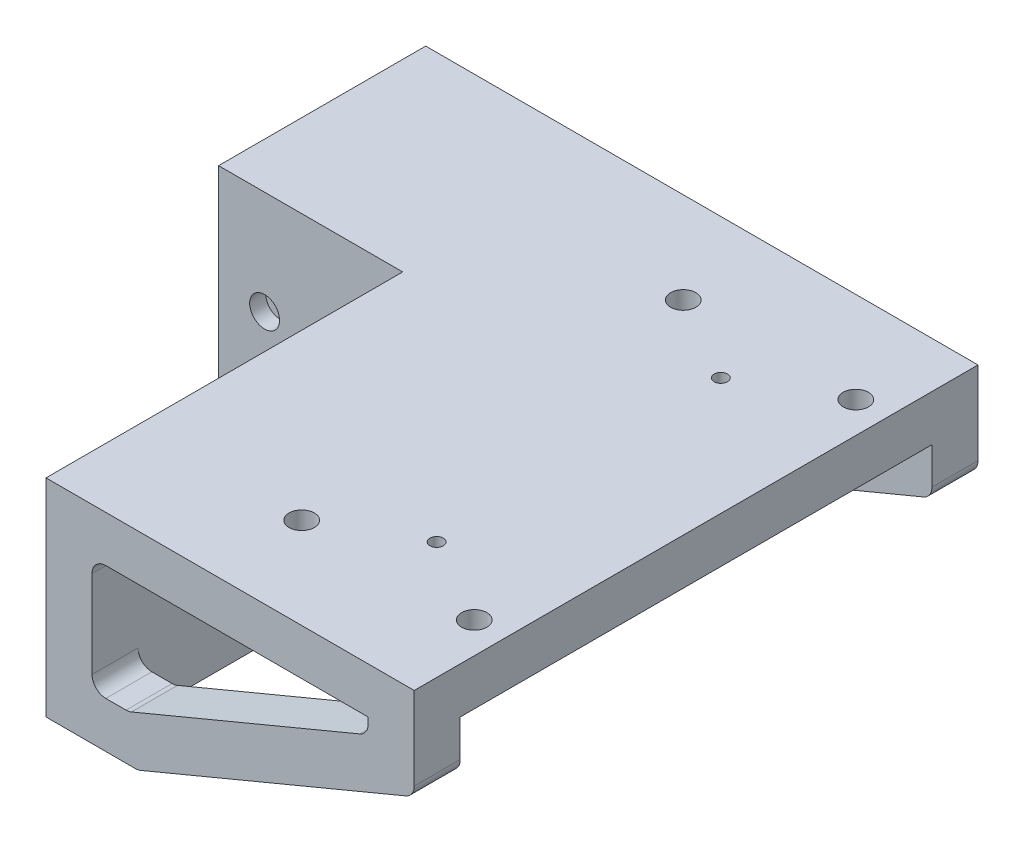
ISO-10303-21;
HEADER;
FILE_DESCRIPTION(('STEP AP214'),'2;1');
FILE_NAME('part.step','',(''),(''),'','','');
FILE_SCHEMA(('AUTOMOTIVE_DESIGN { 1 0 10303 214 1 1 1 1 }'));
ENDSEC;
DATA;
#1=APPLICATION_CONTEXT('core data for automotive mechanical design processes');
#2=APPLICATION_PROTOCOL_DEFINITION('international standard','automotive_design',2000,#1);
#3=PRODUCT_CONTEXT('',#1,'mechanical');
#4=PRODUCT('Part','Part','',(#3));
#5=PRODUCT_RELATED_PRODUCT_CATEGORY('part','',(#4));
#6=PRODUCT_DEFINITION_FORMATION('','',#4);
#7=PRODUCT_DEFINITION_CONTEXT('part definition',#1,'design');
#8=PRODUCT_DEFINITION('design','',#6,#7);
#9=PRODUCT_DEFINITION_SHAPE('','',#8);
#10=(LENGTH_UNIT() NAMED_UNIT(*) SI_UNIT(.MILLI.,.METRE.));
#11=(NAMED_UNIT(*) PLANE_ANGLE_UNIT() SI_UNIT($,.RADIAN.));
#12=(NAMED_UNIT(*) SI_UNIT($,.STERADIAN.) SOLID_ANGLE_UNIT());
#13=UNCERTAINTY_MEASURE_WITH_UNIT(LENGTH_MEASURE(1.E-05),#10,'distance_accuracy_value','');
#14=(GEOMETRIC_REPRESENTATION_CONTEXT(3) GLOBAL_UNCERTAINTY_ASSIGNED_CONTEXT((#13)) GLOBAL_UNIT_ASSIGNED_CONTEXT((#10,
#11,#12)) REPRESENTATION_CONTEXT('',''));
#15=CARTESIAN_POINT('',(0.,0.,0.));
#16=DIRECTION('',(0.,0.,1.));
#17=DIRECTION('',(1.,0.,0.));
#18=AXIS2_PLACEMENT_3D('',#15,#16,#17);
#19=CARTESIAN_POINT('',(120.,2.5,-114.287798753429));
#20=DIRECTION('',(0.384615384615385,-0.923076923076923,0.));
#21=DIRECTION('',(0.923076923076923,0.384615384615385,0.));
#22=AXIS2_PLACEMENT_3D('',#19,#20,#21);
#23=PLANE('',#22);
#24=DIRECTION('',(0.923076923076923,0.384615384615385,0.));
#25=VECTOR('',#24,1.);
#26=CARTESIAN_POINT('',(120.,2.5,-12.5));
#27=LINE('',#26,#25);
#28=CARTESIAN_POINT('',(60.5538461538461,-22.2692307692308,-12.5));
#29=VERTEX_POINT('',#28);
#30=CARTESIAN_POINT('',(118.153846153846,1.73076923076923,-12.5));
#31=VERTEX_POINT('',#30);
#32=EDGE_CURVE('E324',#29,#31,#27,.T.);
#33=ORIENTED_EDGE('',*,*,#32,.F.);
#34=DIRECTION('',(0.,0.,1.));
#35=VECTOR('',#34,1.);
#36=CARTESIAN_POINT('',(60.5538461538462,-22.2692307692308,-22.5));
#37=LINE('',#36,#35);
#38=CARTESIAN_POINT('',(60.5538461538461,-22.2692307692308,-22.5));
#39=VERTEX_POINT('',#38);
#40=EDGE_CURVE('E534',#29,#39,#37,.F.);
#41=ORIENTED_EDGE('',*,*,#40,.T.);
#42=DIRECTION('',(-0.923076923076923,-0.384615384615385,0.));
#43=VECTOR('',#42,1.);
#44=CARTESIAN_POINT('',(120.,2.5,-22.5));
#45=LINE('',#44,#43);
#46=CARTESIAN_POINT('',(118.153846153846,1.73076923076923,-22.5));
#47=VERTEX_POINT('',#46);
#48=EDGE_CURVE('E369',#47,#39,#45,.T.);
#49=ORIENTED_EDGE('',*,*,#48,.F.);
#50=DIRECTION('',(0.,0.,1.));
#51=VECTOR('',#50,1.);
#52=CARTESIAN_POINT('',(118.153846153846,1.73076923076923,-114.287798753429));
#53=LINE('',#52,#51);
#54=EDGE_CURVE('E531',#47,#31,#53,.T.);
#55=ORIENTED_EDGE('',*,*,#54,.T.);
#56=EDGE_LOOP('',(#33,#41,#49,#55));
#57=FACE_BOUND('',#56,.T.);
#58=ADVANCED_FACE('F45',(#57),#23,.T.);
#59=CARTESIAN_POINT('',(58.,-12.5,-114.287798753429));
#60=DIRECTION('',(0.,-1.,0.));
#61=DIRECTION('',(1.,0.,0.));
#62=AXIS2_PLACEMENT_3D('',#59,#60,#61);
#63=PLANE('',#62);
#64=DIRECTION('',(-1.,0.,0.));
#65=VECTOR('',#64,1.);
#66=CARTESIAN_POINT('',(58.,-12.5,-22.5));
#67=LINE('',#66,#65);
#68=CARTESIAN_POINT('',(57.4,-12.5,-22.5));
#69=VERTEX_POINT('',#68);
#70=CARTESIAN_POINT('',(53.,-12.5,-22.5));
#71=VERTEX_POINT('',#70);
#72=EDGE_CURVE('E372',#69,#71,#67,.T.);
#73=ORIENTED_EDGE('',*,*,#72,.T.);
#74=DIRECTION('',(0.,0.,1.));
#75=VECTOR('',#74,1.);
#76=CARTESIAN_POINT('',(53.,-12.5,-12.5));
#77=LINE('',#76,#75);
#78=CARTESIAN_POINT('',(53.,-12.5,-12.5));
#79=VERTEX_POINT('',#78);
#80=EDGE_CURVE('E506',#71,#79,#77,.T.);
#81=ORIENTED_EDGE('',*,*,#80,.T.);
#82=DIRECTION('',(1.,0.,0.));
#83=VECTOR('',#82,1.);
#84=CARTESIAN_POINT('',(58.,-12.5,-12.5));
#85=LINE('',#84,#83);
#86=CARTESIAN_POINT('',(57.4,-12.5,-12.5));
#87=VERTEX_POINT('',#86);
#88=EDGE_CURVE('E321',#79,#87,#85,.T.);
#89=ORIENTED_EDGE('',*,*,#88,.T.);
#90=DIRECTION('',(0.,0.,1.));
#91=VECTOR('',#90,1.);
#92=CARTESIAN_POINT('',(57.4,-12.5,-22.5));
#93=LINE('',#92,#91);
#94=EDGE_CURVE('E504',#87,#69,#93,.F.);
#95=ORIENTED_EDGE('',*,*,#94,.T.);
#96=EDGE_LOOP('',(#73,#81,#89,#95));
#97=FACE_BOUND('',#96,.T.);
#98=ADVANCED_FACE('F582',(#97),#63,.F.);
#99=CARTESIAN_POINT('',(110.,9.16666666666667,-114.287798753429));
#100=DIRECTION('',(0.384615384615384,-0.923076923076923,0.));
#101=DIRECTION('',(0.923076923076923,0.384615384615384,0.));
#102=AXIS2_PLACEMENT_3D('',#99,#100,#101);
#103=PLANE('',#102);
#104=DIRECTION('',(0.923076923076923,0.384615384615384,0.));
#105=VECTOR('',#104,1.);
#106=CARTESIAN_POINT('',(110.,9.16666666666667,-12.5));
#107=LINE('',#106,#105);
#108=CARTESIAN_POINT('',(58.5538461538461,-12.2692307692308,-12.5));
#109=VERTEX_POINT('',#108);
#110=CARTESIAN_POINT('',(108.153846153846,8.3974358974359,-12.5));
#111=VERTEX_POINT('',#110);
#112=EDGE_CURVE('E318',#109,#111,#107,.T.);
#113=ORIENTED_EDGE('',*,*,#112,.T.);
#114=DIRECTION('',(0.,0.,1.));
#115=VECTOR('',#114,1.);
#116=CARTESIAN_POINT('',(108.153846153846,8.3974358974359,-22.5));
#117=LINE('',#116,#115);
#118=CARTESIAN_POINT('',(108.153846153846,8.3974358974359,-22.5));
#119=VERTEX_POINT('',#118);
#120=EDGE_CURVE('E494',#111,#119,#117,.F.);
#121=ORIENTED_EDGE('',*,*,#120,.T.);
#122=DIRECTION('',(-0.923076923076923,-0.384615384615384,0.));
#123=VECTOR('',#122,1.);
#124=CARTESIAN_POINT('',(110.,9.16666666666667,-22.5));
#125=LINE('',#124,#123);
#126=CARTESIAN_POINT('',(58.5538461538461,-12.2692307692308,-22.5));
#127=VERTEX_POINT('',#126);
#128=EDGE_CURVE('E356',#119,#127,#125,.T.);
#129=ORIENTED_EDGE('',*,*,#128,.T.);
#130=DIRECTION('',(0.,0.,1.));
#131=VECTOR('',#130,1.);
#132=CARTESIAN_POINT('',(58.5538461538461,-12.2692307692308,-12.5));
#133=LINE('',#132,#131);
#134=EDGE_CURVE('E491',#127,#109,#133,.T.);
#135=ORIENTED_EDGE('',*,*,#134,.T.);
#136=EDGE_LOOP('',(#113,#121,#129,#135));
#137=FACE_BOUND('',#136,.T.);
#138=ADVANCED_FACE('F592',(#137),#103,.F.);
#139=CARTESIAN_POINT('',(110.,12.5,-114.287798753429));
#140=DIRECTION('',(1.,0.,0.));
#141=DIRECTION('',(0.,0.,-1.));
#142=AXIS2_PLACEMENT_3D('',#139,#140,#141);
#143=PLANE('',#142);
#144=DIRECTION('',(0.,-1.,0.));
#145=VECTOR('',#144,1.);
#146=CARTESIAN_POINT('',(110.,12.5,-22.5));
#147=LINE('',#146,#145);
#148=CARTESIAN_POINT('',(110.,12.5,-22.5));
#149=VERTEX_POINT('',#148);
#150=CARTESIAN_POINT('',(110.,11.1666666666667,-22.5));
#151=VERTEX_POINT('',#150);
#152=EDGE_CURVE('E360',#149,#151,#147,.T.);
#153=ORIENTED_EDGE('',*,*,#152,.T.);
#154=DIRECTION('',(0.,0.,1.));
#155=VECTOR('',#154,1.);
#156=CARTESIAN_POINT('',(110.,11.1666666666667,-12.5));
#157=LINE('',#156,#155);
#158=CARTESIAN_POINT('',(110.,11.1666666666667,-12.5));
#159=VERTEX_POINT('',#158);
#160=EDGE_CURVE('E483',#151,#159,#157,.T.);
#161=ORIENTED_EDGE('',*,*,#160,.T.);
#162=DIRECTION('',(0.,1.,0.));
#163=VECTOR('',#162,1.);
#164=CARTESIAN_POINT('',(110.,12.5,-12.5));
#165=LINE('',#164,#163);
#166=CARTESIAN_POINT('',(110.,12.5000000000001,-12.5));
#167=VERTEX_POINT('',#166);
#168=EDGE_CURVE('E316',#159,#167,#165,.T.);
#169=ORIENTED_EDGE('',*,*,#168,.T.);
#170=DIRECTION('',(0.,0.,1.));
#171=VECTOR('',#170,1.);
#172=CARTESIAN_POINT('',(110.,12.5,-114.287798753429));
#173=LINE('',#172,#171);
#174=EDGE_CURVE('E375',#149,#167,#173,.T.);
#175=ORIENTED_EDGE('',*,*,#174,.F.);
#176=EDGE_LOOP('',(#153,#161,#169,#175));
#177=FACE_BOUND('',#176,.T.);
#178=ADVANCED_FACE('F601',(#177),#143,.F.);
#179=CARTESIAN_POINT('',(40.,-22.5,-22.5));
#180=DIRECTION('',(0.,0.,1.));
#181=DIRECTION('',(1.,0.,0.));
#182=AXIS2_PLACEMENT_3D('',#179,#180,#181);
#183=PLANE('',#182);
#184=CARTESIAN_POINT('',(25.,0.,-22.5));
#185=DIRECTION('',(0.,0.,-1.));
#186=DIRECTION('',(-1.,0.,0.));
#187=AXIS2_PLACEMENT_3D('',#184,#185,#186);
#188=CIRCLE('',#187,3.25);
#189=CARTESIAN_POINT('',(21.75,0.,-22.5));
#190=VERTEX_POINT('',#189);
#191=EDGE_CURVE('E422',#190,#190,#188,.T.);
#192=ORIENTED_EDGE('',*,*,#191,.F.);
#193=EDGE_LOOP('',(#192));
#194=FACE_BOUND('',#193,.T.);
#195=ORIENTED_EDGE('',*,*,#48,.T.);
#196=CARTESIAN_POINT('',(59.4,-19.5,-22.5));
#197=DIRECTION('',(0.,0.,1.));
#198=DIRECTION('',(1.,0.,0.));
#199=AXIS2_PLACEMENT_3D('',#196,#197,#198);
#200=CIRCLE('',#199,3.);
#201=CARTESIAN_POINT('',(59.4,-22.5,-22.5));
#202=VERTEX_POINT('',#201);
#203=EDGE_CURVE('E538',#39,#202,#200,.F.);
#204=ORIENTED_EDGE('',*,*,#203,.T.);
#205=DIRECTION('',(-1.,0.,0.));
#206=VECTOR('',#205,1.);
#207=CARTESIAN_POINT('',(40.,-22.5,-22.5));
#208=LINE('',#207,#206);
#209=CARTESIAN_POINT('',(0.,-22.5,-22.5));
#210=VERTEX_POINT('',#209);
#211=EDGE_CURVE('E484',#202,#210,#208,.T.);
#212=ORIENTED_EDGE('',*,*,#211,.T.);
#213=DIRECTION('',(0.,1.,0.));
#214=VECTOR('',#213,1.);
#215=CARTESIAN_POINT('',(0.,-22.5,-22.5));
#216=LINE('',#215,#214);
#217=CARTESIAN_POINT('',(0.,22.5,-22.5));
#218=VERTEX_POINT('',#217);
#219=EDGE_CURVE('E476',#210,#218,#216,.T.);
#220=ORIENTED_EDGE('',*,*,#219,.T.);
#221=DIRECTION('',(-1.,0.,0.));
#222=VECTOR('',#221,1.);
#223=CARTESIAN_POINT('',(40.,22.5,-22.5));
#224=LINE('',#223,#222);
#225=CARTESIAN_POINT('',(120.,22.5,-22.5));
#226=VERTEX_POINT('',#225);
#227=EDGE_CURVE('E486',#226,#218,#224,.T.);
#228=ORIENTED_EDGE('',*,*,#227,.F.);
#229=DIRECTION('',(0.,-1.,0.));
#230=VECTOR('',#229,1.);
#231=CARTESIAN_POINT('',(120.,22.5,-22.5));
#232=LINE('',#231,#230);
#233=CARTESIAN_POINT('',(120.,4.5,-22.5));
#234=VERTEX_POINT('',#233);
#235=EDGE_CURVE('E368',#226,#234,#232,.T.);
#236=ORIENTED_EDGE('',*,*,#235,.T.);
#237=CARTESIAN_POINT('',(117.,4.5,-22.5));
#238=DIRECTION('',(0.,0.,1.));
#239=DIRECTION('',(1.,0.,0.));
#240=AXIS2_PLACEMENT_3D('',#237,#238,#239);
#241=CIRCLE('',#240,3.);
#242=EDGE_CURVE('E536',#234,#47,#241,.F.);
#243=ORIENTED_EDGE('',*,*,#242,.T.);
#244=EDGE_LOOP('',(#195,#204,#212,#220,#228,#236,#243));
#245=FACE_BOUND('',#244,.T.);
#246=CARTESIAN_POINT('',(10.,0.,-22.5));
#247=DIRECTION('',(0.,0.,-1.));
#248=DIRECTION('',(-1.,0.,0.));
#249=AXIS2_PLACEMENT_3D('',#246,#247,#248);
#250=CIRCLE('',#249,3.25);
#251=CARTESIAN_POINT('',(6.75,0.,-22.5));
#252=VERTEX_POINT('',#251);
#253=EDGE_CURVE('E410',#252,#252,#250,.T.);
#254=ORIENTED_EDGE('',*,*,#253,.F.);
#255=EDGE_LOOP('',(#254));
#256=FACE_BOUND('',#255,.T.);
#257=ORIENTED_EDGE('',*,*,#72,.F.);
#258=CARTESIAN_POINT('',(57.4,-9.50000000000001,-22.5));
#259=DIRECTION('',(0.,0.,1.));
#260=DIRECTION('',(1.,0.,0.));
#261=AXIS2_PLACEMENT_3D('',#258,#259,#260);
#262=CIRCLE('',#261,3.);
#263=EDGE_CURVE('E11',#69,#127,#262,.T.);
#264=ORIENTED_EDGE('',*,*,#263,.T.);
#265=ORIENTED_EDGE('',*,*,#128,.F.);
#266=CARTESIAN_POINT('',(107.,11.1666666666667,-22.5));
#267=DIRECTION('',(0.,0.,1.));
#268=DIRECTION('',(1.,0.,0.));
#269=AXIS2_PLACEMENT_3D('',#266,#267,#268);
#270=CIRCLE('',#269,3.);
#271=EDGE_CURVE('E557',#119,#151,#270,.T.);
#272=ORIENTED_EDGE('',*,*,#271,.T.);
#273=ORIENTED_EDGE('',*,*,#152,.F.);
#274=DIRECTION('',(1.,0.,0.));
#275=VECTOR('',#274,1.);
#276=CARTESIAN_POINT('',(50.,12.5,-22.5));
#277=LINE('',#276,#275);
#278=CARTESIAN_POINT('',(53.,12.5,-22.5));
#279=VERTEX_POINT('',#278);
#280=EDGE_CURVE('E363',#279,#149,#277,.T.);
#281=ORIENTED_EDGE('',*,*,#280,.F.);
#282=CARTESIAN_POINT('',(53.,9.49999999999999,-22.5));
#283=DIRECTION('',(0.,0.,1.));
#284=DIRECTION('',(1.,0.,0.));
#285=AXIS2_PLACEMENT_3D('',#282,#283,#284);
#286=CIRCLE('',#285,3.);
#287=CARTESIAN_POINT('',(50.,9.49999999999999,-22.5));
#288=VERTEX_POINT('',#287);
#289=EDGE_CURVE('E568',#279,#288,#286,.T.);
#290=ORIENTED_EDGE('',*,*,#289,.T.);
#291=DIRECTION('',(0.,1.,0.));
#292=VECTOR('',#291,1.);
#293=CARTESIAN_POINT('',(50.,-12.5,-22.5));
#294=LINE('',#293,#292);
#295=CARTESIAN_POINT('',(50.,-9.5,-22.5));
#296=VERTEX_POINT('',#295);
#297=EDGE_CURVE('E365',#296,#288,#294,.T.);
#298=ORIENTED_EDGE('',*,*,#297,.F.);
#299=CARTESIAN_POINT('',(53.,-9.5,-22.5));
#300=DIRECTION('',(0.,0.,1.));
#301=DIRECTION('',(1.,0.,0.));
#302=AXIS2_PLACEMENT_3D('',#299,#300,#301);
#303=CIRCLE('',#302,3.);
#304=EDGE_CURVE('E564',#296,#71,#303,.T.);
#305=ORIENTED_EDGE('',*,*,#304,.T.);
#306=EDGE_LOOP('',(#257,#264,#265,#272,#273,#281,#290,#298,#305));
#307=FACE_BOUND('',#306,.T.);
#308=ADVANCED_FACE('F589',(#194,#245,#256,#307),#183,.F.);
#309=CARTESIAN_POINT('',(0.,0.,0.));
#310=DIRECTION('',(-1.,0.,0.));
#311=DIRECTION('',(0.,0.,1.));
#312=AXIS2_PLACEMENT_3D('',#309,#310,#311);
#313=PLANE('',#312);
#314=DIRECTION('',(0.,1.,0.));
#315=VECTOR('',#314,1.);
#316=CARTESIAN_POINT('',(0.,-22.5,22.5));
#317=LINE('',#316,#315);
#318=CARTESIAN_POINT('',(0.,-22.5,22.5));
#319=VERTEX_POINT('',#318);
#320=CARTESIAN_POINT('',(0.,22.5,22.5));
#321=VERTEX_POINT('',#320);
#322=EDGE_CURVE('E465',#319,#321,#317,.T.);
#323=ORIENTED_EDGE('',*,*,#322,.T.);
#324=DIRECTION('',(0.,0.,-1.));
#325=VECTOR('',#324,1.);
#326=CARTESIAN_POINT('',(0.,22.5,22.5));
#327=LINE('',#326,#325);
#328=EDGE_CURVE('E473',#321,#218,#327,.T.);
#329=ORIENTED_EDGE('',*,*,#328,.T.);
#330=ORIENTED_EDGE('',*,*,#219,.F.);
#331=DIRECTION('',(0.,0.,-1.));
#332=VECTOR('',#331,1.);
#333=CARTESIAN_POINT('',(0.,-22.5,22.5));
#334=LINE('',#333,#332);
#335=EDGE_CURVE('E470',#319,#210,#334,.T.);
#336=ORIENTED_EDGE('',*,*,#335,.F.);
#337=EDGE_LOOP('',(#323,#329,#330,#336));
#338=FACE_BOUND('',#337,.T.);
#339=DIRECTION('',(0.,-1.,0.));
#340=VECTOR('',#339,1.);
#341=CARTESIAN_POINT('',(0.,0.,-12.2474487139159));
#342=LINE('',#341,#340);
#343=CARTESIAN_POINT('',(0.,12.5,-12.2474487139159));
#344=VERTEX_POINT('',#343);
#345=CARTESIAN_POINT('',(0.,-12.5,-12.2474487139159));
#346=VERTEX_POINT('',#345);
#347=EDGE_CURVE('E434',#344,#346,#342,.T.);
#348=ORIENTED_EDGE('',*,*,#347,.F.);
#349=CARTESIAN_POINT('',(0.,0.,0.));
#350=DIRECTION('',(1.,0.,0.));
#351=DIRECTION('',(0.,0.,-1.));
#352=AXIS2_PLACEMENT_3D('',#349,#350,#351);
#353=CIRCLE('',#352,17.5);
#354=CARTESIAN_POINT('',(0.,12.5,12.2474487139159));
#355=VERTEX_POINT('',#354);
#356=EDGE_CURVE('E449',#344,#355,#353,.T.);
#357=ORIENTED_EDGE('',*,*,#356,.T.);
#358=DIRECTION('',(0.,1.,0.));
#359=VECTOR('',#358,1.);
#360=CARTESIAN_POINT('',(0.,0.,12.2474487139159));
#361=LINE('',#360,#359);
#362=CARTESIAN_POINT('',(0.,-12.5,12.2474487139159));
#363=VERTEX_POINT('',#362);
#364=EDGE_CURVE('E452',#363,#355,#361,.T.);
#365=ORIENTED_EDGE('',*,*,#364,.F.);
#366=CARTESIAN_POINT('',(0.,0.,0.));
#367=DIRECTION('',(1.,0.,0.));
#368=DIRECTION('',(0.,0.,-1.));
#369=AXIS2_PLACEMENT_3D('',#366,#367,#368);
#370=CIRCLE('',#369,17.5);
#371=EDGE_CURVE('E439',#363,#346,#370,.T.);
#372=ORIENTED_EDGE('',*,*,#371,.T.);
#373=EDGE_LOOP('',(#348,#357,#365,#372));
#374=FACE_BOUND('',#373,.T.);
#375=ADVANCED_FACE('F766',(#338,#374),#313,.T.);
#376=CARTESIAN_POINT('',(40.,-22.5,22.5));
#377=DIRECTION('',(0.,0.,1.));
#378=DIRECTION('',(1.,0.,0.));
#379=AXIS2_PLACEMENT_3D('',#376,#377,#378);
#380=PLANE('',#379);
#381=CARTESIAN_POINT('',(10.,0.,22.5));
#382=DIRECTION('',(0.,0.,1.));
#383=DIRECTION('',(1.,0.,0.));
#384=AXIS2_PLACEMENT_3D('',#381,#382,#383);
#385=CIRCLE('',#384,3.25);
#386=CARTESIAN_POINT('',(13.25,0.,22.5));
#387=VERTEX_POINT('',#386);
#388=EDGE_CURVE('E359',#387,#387,#385,.T.);
#389=ORIENTED_EDGE('',*,*,#388,.F.);
#390=EDGE_LOOP('',(#389));
#391=FACE_BOUND('',#390,.T.);
#392=CARTESIAN_POINT('',(25.,0.,22.5));
#393=DIRECTION('',(0.,0.,1.));
#394=DIRECTION('',(1.,0.,0.));
#395=AXIS2_PLACEMENT_3D('',#392,#393,#394);
#396=CIRCLE('',#395,3.25);
#397=CARTESIAN_POINT('',(28.25,0.,22.5));
#398=VERTEX_POINT('',#397);
#399=EDGE_CURVE('E398',#398,#398,#396,.T.);
#400=ORIENTED_EDGE('',*,*,#399,.F.);
#401=EDGE_LOOP('',(#400));
#402=FACE_BOUND('',#401,.T.);
#403=ORIENTED_EDGE('',*,*,#322,.F.);
#404=DIRECTION('',(-1.,0.,0.));
#405=VECTOR('',#404,1.);
#406=CARTESIAN_POINT('',(40.,-22.5,22.5));
#407=LINE('',#406,#405);
#408=CARTESIAN_POINT('',(40.,-22.5,22.5));
#409=VERTEX_POINT('',#408);
#410=EDGE_CURVE('E481',#409,#319,#407,.T.);
#411=ORIENTED_EDGE('',*,*,#410,.F.);
#412=DIRECTION('',(0.,1.,0.));
#413=VECTOR('',#412,1.);
#414=CARTESIAN_POINT('',(40.,-22.5,22.5));
#415=LINE('',#414,#413);
#416=CARTESIAN_POINT('',(40.,22.5,22.5));
#417=VERTEX_POINT('',#416);
#418=EDGE_CURVE('E466',#409,#417,#415,.T.);
#419=ORIENTED_EDGE('',*,*,#418,.T.);
#420=DIRECTION('',(-1.,0.,0.));
#421=VECTOR('',#420,1.);
#422=CARTESIAN_POINT('',(40.,22.5,22.5));
#423=LINE('',#422,#421);
#424=EDGE_CURVE('E469',#417,#321,#423,.T.);
#425=ORIENTED_EDGE('',*,*,#424,.T.);
#426=EDGE_LOOP('',(#403,#411,#419,#425));
#427=FACE_BOUND('',#426,.T.);
#428=ADVANCED_FACE('F770',(#391,#402,#427),#380,.T.);
#429=CARTESIAN_POINT('',(40.,-22.5,22.5));
#430=DIRECTION('',(0.,1.,0.));
#431=DIRECTION('',(0.,0.,1.));
#432=AXIS2_PLACEMENT_3D('',#429,#430,#431);
#433=PLANE('',#432);
#434=ORIENTED_EDGE('',*,*,#211,.F.);
#435=DIRECTION('',(0.,0.,1.));
#436=VECTOR('',#435,1.);
#437=CARTESIAN_POINT('',(59.4,-22.5,-12.5));
#438=LINE('',#437,#436);
#439=CARTESIAN_POINT('',(59.4,-22.4999999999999,-12.5));
#440=VERTEX_POINT('',#439);
#441=EDGE_CURVE('E298',#202,#440,#438,.T.);
#442=ORIENTED_EDGE('',*,*,#441,.T.);
#443=DIRECTION('',(1.,0.,0.));
#444=VECTOR('',#443,1.);
#445=CARTESIAN_POINT('',(-58.3108951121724,-22.4999999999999,-12.5));
#446=LINE('',#445,#444);
#447=CARTESIAN_POINT('',(50.,-22.4999999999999,-12.5));
#448=VERTEX_POINT('',#447);
#449=EDGE_CURVE('E277',#448,#440,#446,.T.);
#450=ORIENTED_EDGE('',*,*,#449,.F.);
#451=DIRECTION('',(0.,0.,-1.));
#452=VECTOR('',#451,1.);
#453=CARTESIAN_POINT('',(50.,-22.4999999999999,90.));
#454=LINE('',#453,#452);
#455=CARTESIAN_POINT('',(50.,-22.4999999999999,90.));
#456=VERTEX_POINT('',#455);
#457=EDGE_CURVE('E285',#456,#448,#454,.T.);
#458=ORIENTED_EDGE('',*,*,#457,.F.);
#459=DIRECTION('',(1.,0.,0.));
#460=VECTOR('',#459,1.);
#461=CARTESIAN_POINT('',(-58.3108951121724,-22.4999999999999,90.));
#462=LINE('',#461,#460);
#463=CARTESIAN_POINT('',(59.4,-22.4999999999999,90.));
#464=VERTEX_POINT('',#463);
#465=EDGE_CURVE('E303',#456,#464,#462,.T.);
#466=ORIENTED_EDGE('',*,*,#465,.T.);
#467=DIRECTION('',(0.,0.,1.));
#468=VECTOR('',#467,1.);
#469=CARTESIAN_POINT('',(59.4,-22.5,100.));
#470=LINE('',#469,#468);
#471=CARTESIAN_POINT('',(59.4,-22.5,100.));
#472=VERTEX_POINT('',#471);
#473=EDGE_CURVE('E523',#464,#472,#470,.T.);
#474=ORIENTED_EDGE('',*,*,#473,.T.);
#475=DIRECTION('',(1.,0.,0.));
#476=VECTOR('',#475,1.);
#477=CARTESIAN_POINT('',(60.,-22.5,100.));
#478=LINE('',#477,#476);
#479=CARTESIAN_POINT('',(40.,-22.5,100.));
#480=VERTEX_POINT('',#479);
#481=EDGE_CURVE('E344',#480,#472,#478,.T.);
#482=ORIENTED_EDGE('',*,*,#481,.F.);
#483=DIRECTION('',(0.,0.,1.));
#484=VECTOR('',#483,1.);
#485=CARTESIAN_POINT('',(40.,-22.5,-114.287798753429));
#486=LINE('',#485,#484);
#487=EDGE_CURVE('E378',#409,#480,#486,.T.);
#488=ORIENTED_EDGE('',*,*,#487,.F.);
#489=ORIENTED_EDGE('',*,*,#410,.T.);
#490=ORIENTED_EDGE('',*,*,#335,.T.);
#491=EDGE_LOOP('',(#434,#442,#450,#458,#466,#474,#482,#488,#489,#490));
#492=FACE_BOUND('',#491,.T.);
#493=ADVANCED_FACE('F296',(#492),#433,.F.);
#494=CARTESIAN_POINT('',(40.,22.5,22.5));
#495=DIRECTION('',(0.,1.,0.));
#496=DIRECTION('',(0.,0.,1.));
#497=AXIS2_PLACEMENT_3D('',#494,#495,#496);
#498=PLANE('',#497);
#499=CARTESIAN_POINT('',(113.25,22.5,-2.7));
#500=DIRECTION('',(0.,1.,0.));
#501=DIRECTION('',(0.,0.,1.));
#502=AXIS2_PLACEMENT_3D('',#499,#500,#501);
#503=CIRCLE('',#502,2.75);
#504=CARTESIAN_POINT('',(113.25,22.5,0.0500000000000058));
#505=VERTEX_POINT('',#504);
#506=EDGE_CURVE('E707',#505,#505,#503,.F.);
#507=ORIENTED_EDGE('',*,*,#506,.T.);
#508=EDGE_LOOP('',(#507));
#509=FACE_BOUND('',#508,.T.);
#510=CARTESIAN_POINT('',(75.75,22.5,-2.7));
#511=DIRECTION('',(0.,1.,0.));
#512=DIRECTION('',(0.,0.,1.));
#513=AXIS2_PLACEMENT_3D('',#510,#511,#512);
#514=CIRCLE('',#513,2.75);
#515=CARTESIAN_POINT('',(75.75,22.5,0.050000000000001));
#516=VERTEX_POINT('',#515);
#517=EDGE_CURVE('E695',#516,#516,#514,.F.);
#518=ORIENTED_EDGE('',*,*,#517,.T.);
#519=EDGE_LOOP('',(#518));
#520=FACE_BOUND('',#519,.T.);
#521=CARTESIAN_POINT('',(113.25,22.5,80.2));
#522=DIRECTION('',(0.,1.,0.));
#523=DIRECTION('',(0.,0.,1.));
#524=AXIS2_PLACEMENT_3D('',#521,#522,#523);
#525=CIRCLE('',#524,2.75);
#526=CARTESIAN_POINT('',(113.25,22.5,82.95));
#527=VERTEX_POINT('',#526);
#528=EDGE_CURVE('E683',#527,#527,#525,.F.);
#529=ORIENTED_EDGE('',*,*,#528,.T.);
#530=EDGE_LOOP('',(#529));
#531=FACE_BOUND('',#530,.T.);
#532=CARTESIAN_POINT('',(75.75,22.5,80.2));
#533=DIRECTION('',(0.,1.,0.));
#534=DIRECTION('',(0.,0.,1.));
#535=AXIS2_PLACEMENT_3D('',#532,#533,#534);
#536=CIRCLE('',#535,2.75);
#537=CARTESIAN_POINT('',(75.75,22.5,82.95));
#538=VERTEX_POINT('',#537);
#539=EDGE_CURVE('E671',#538,#538,#536,.F.);
#540=ORIENTED_EDGE('',*,*,#539,.T.);
#541=EDGE_LOOP('',(#540));
#542=FACE_BOUND('',#541,.T.);
#543=CARTESIAN_POINT('',(94.5,22.5,7.87500000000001));
#544=DIRECTION('',(0.,1.,0.));
#545=DIRECTION('',(0.,0.,1.));
#546=AXIS2_PLACEMENT_3D('',#543,#544,#545);
#547=CIRCLE('',#546,1.44999999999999);
#548=CARTESIAN_POINT('',(94.5,22.5,9.325));
#549=VERTEX_POINT('',#548);
#550=EDGE_CURVE('E665',#549,#549,#547,.T.);
#551=ORIENTED_EDGE('',*,*,#550,.F.);
#552=EDGE_LOOP('',(#551));
#553=FACE_BOUND('',#552,.T.);
#554=CARTESIAN_POINT('',(94.5,22.5,69.625));
#555=DIRECTION('',(0.,1.,0.));
#556=DIRECTION('',(0.,0.,1.));
#557=AXIS2_PLACEMENT_3D('',#554,#555,#556);
#558=CIRCLE('',#557,1.44999999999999);
#559=CARTESIAN_POINT('',(94.5,22.5,71.075));
#560=VERTEX_POINT('',#559);
#561=EDGE_CURVE('E659',#560,#560,#558,.T.);
#562=ORIENTED_EDGE('',*,*,#561,.F.);
#563=EDGE_LOOP('',(#562));
#564=FACE_BOUND('',#563,.T.);
#565=ORIENTED_EDGE('',*,*,#328,.F.);
#566=ORIENTED_EDGE('',*,*,#424,.F.);
#567=DIRECTION('',(0.,0.,1.));
#568=VECTOR('',#567,1.);
#569=CARTESIAN_POINT('',(40.,22.5,-114.287798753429));
#570=LINE('',#569,#568);
#571=CARTESIAN_POINT('',(40.,22.5,100.));
#572=VERTEX_POINT('',#571);
#573=EDGE_CURVE('E379',#417,#572,#570,.T.);
#574=ORIENTED_EDGE('',*,*,#573,.T.);
#575=DIRECTION('',(-1.,0.,0.));
#576=VECTOR('',#575,1.);
#577=CARTESIAN_POINT('',(40.,22.5,100.));
#578=LINE('',#577,#576);
#579=CARTESIAN_POINT('',(120.,22.5,100.));
#580=VERTEX_POINT('',#579);
#581=EDGE_CURVE('E352',#580,#572,#578,.T.);
#582=ORIENTED_EDGE('',*,*,#581,.F.);
#583=DIRECTION('',(0.,0.,1.));
#584=VECTOR('',#583,1.);
#585=CARTESIAN_POINT('',(120.,22.5,-114.287798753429));
#586=LINE('',#585,#584);
#587=EDGE_CURVE('E381',#226,#580,#586,.T.);
#588=ORIENTED_EDGE('',*,*,#587,.F.);
#589=ORIENTED_EDGE('',*,*,#227,.T.);
#590=EDGE_LOOP('',(#565,#566,#574,#582,#588,#589));
#591=FACE_BOUND('',#590,.T.);
#592=ADVANCED_FACE('F753',(#509,#520,#531,#542,#553,#564,#591),#498,.T.);
#593=CARTESIAN_POINT('',(40.,0.,-12.2474487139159));
#594=DIRECTION('',(0.,0.,-1.));
#595=DIRECTION('',(0.,1.,0.));
#596=AXIS2_PLACEMENT_3D('',#593,#594,#595);
#597=PLANE('',#596);
#598=CARTESIAN_POINT('',(10.,0.,-12.2474487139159));
#599=DIRECTION('',(0.,0.,-1.));
#600=DIRECTION('',(0.,1.,0.));
#601=AXIS2_PLACEMENT_3D('',#598,#599,#600);
#602=CIRCLE('',#601,1.7);
#603=CARTESIAN_POINT('',(10.,1.7,-12.2474487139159));
#604=VERTEX_POINT('',#603);
#605=EDGE_CURVE('E419',#604,#604,#602,.T.);
#606=ORIENTED_EDGE('',*,*,#605,.T.);
#607=EDGE_LOOP('',(#606));
#608=FACE_BOUND('',#607,.T.);
#609=CARTESIAN_POINT('',(25.,0.,-12.2474487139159));
#610=DIRECTION('',(0.,0.,-1.));
#611=DIRECTION('',(0.,1.,0.));
#612=AXIS2_PLACEMENT_3D('',#609,#610,#611);
#613=CIRCLE('',#612,1.7);
#614=CARTESIAN_POINT('',(25.,1.7,-12.2474487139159));
#615=VERTEX_POINT('',#614);
#616=EDGE_CURVE('E431',#615,#615,#613,.T.);
#617=ORIENTED_EDGE('',*,*,#616,.T.);
#618=EDGE_LOOP('',(#617));
#619=FACE_BOUND('',#618,.T.);
#620=ORIENTED_EDGE('',*,*,#347,.T.);
#621=DIRECTION('',(-1.,0.,0.));
#622=VECTOR('',#621,1.);
#623=CARTESIAN_POINT('',(40.,-12.5,-12.2474487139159));
#624=LINE('',#623,#622);
#625=CARTESIAN_POINT('',(40.,-12.5,-12.2474487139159));
#626=VERTEX_POINT('',#625);
#627=EDGE_CURVE('E447',#626,#346,#624,.T.);
#628=ORIENTED_EDGE('',*,*,#627,.F.);
#629=DIRECTION('',(0.,-1.,0.));
#630=VECTOR('',#629,1.);
#631=CARTESIAN_POINT('',(40.,0.,-12.2474487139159));
#632=LINE('',#631,#630);
#633=CARTESIAN_POINT('',(40.,12.5,-12.2474487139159));
#634=VERTEX_POINT('',#633);
#635=EDGE_CURVE('E435',#634,#626,#632,.T.);
#636=ORIENTED_EDGE('',*,*,#635,.F.);
#637=DIRECTION('',(-1.,0.,0.));
#638=VECTOR('',#637,1.);
#639=CARTESIAN_POINT('',(40.,12.5,-12.2474487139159));
#640=LINE('',#639,#638);
#641=EDGE_CURVE('E463',#634,#344,#640,.T.);
#642=ORIENTED_EDGE('',*,*,#641,.T.);
#643=EDGE_LOOP('',(#620,#628,#636,#642));
#644=FACE_BOUND('',#643,.T.);
#645=ADVANCED_FACE('F756',(#608,#619,#644),#597,.F.);
#646=CARTESIAN_POINT('',(40.,0.,0.));
#647=DIRECTION('',(-1.,0.,0.));
#648=DIRECTION('',(0.,0.,1.));
#649=AXIS2_PLACEMENT_3D('',#646,#647,#648);
#650=CYLINDRICAL_SURFACE('',#649,17.5);
#651=ORIENTED_EDGE('',*,*,#356,.F.);
#652=ORIENTED_EDGE('',*,*,#641,.F.);
#653=CARTESIAN_POINT('',(40.,0.,0.));
#654=DIRECTION('',(1.,0.,0.));
#655=DIRECTION('',(0.,0.,-1.));
#656=AXIS2_PLACEMENT_3D('',#653,#654,#655);
#657=CIRCLE('',#656,17.5);
#658=CARTESIAN_POINT('',(40.,12.5,12.2474487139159));
#659=VERTEX_POINT('',#658);
#660=EDGE_CURVE('E438',#634,#659,#657,.T.);
#661=ORIENTED_EDGE('',*,*,#660,.T.);
#662=DIRECTION('',(-1.,0.,0.));
#663=VECTOR('',#662,1.);
#664=CARTESIAN_POINT('',(40.,12.5,12.2474487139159));
#665=LINE('',#664,#663);
#666=EDGE_CURVE('E461',#659,#355,#665,.T.);
#667=ORIENTED_EDGE('',*,*,#666,.T.);
#668=EDGE_LOOP('',(#651,#652,#661,#667));
#669=FACE_BOUND('',#668,.T.);
#670=ADVANCED_FACE('F1228',(#669),#650,.F.);
#671=CARTESIAN_POINT('',(40.,0.,12.2474487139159));
#672=DIRECTION('',(0.,0.,1.));
#673=DIRECTION('',(1.,0.,0.));
#674=AXIS2_PLACEMENT_3D('',#671,#672,#673);
#675=PLANE('',#674);
#676=CARTESIAN_POINT('',(10.,0.,12.2474487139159));
#677=DIRECTION('',(0.,0.,1.));
#678=DIRECTION('',(1.,0.,0.));
#679=AXIS2_PLACEMENT_3D('',#676,#677,#678);
#680=CIRCLE('',#679,1.7);
#681=CARTESIAN_POINT('',(11.7,0.,12.2474487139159));
#682=VERTEX_POINT('',#681);
#683=EDGE_CURVE('E395',#682,#682,#680,.T.);
#684=ORIENTED_EDGE('',*,*,#683,.T.);
#685=EDGE_LOOP('',(#684));
#686=FACE_BOUND('',#685,.T.);
#687=CARTESIAN_POINT('',(25.,0.,12.2474487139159));
#688=DIRECTION('',(0.,0.,1.));
#689=DIRECTION('',(1.,0.,0.));
#690=AXIS2_PLACEMENT_3D('',#687,#688,#689);
#691=CIRCLE('',#690,1.7);
#692=CARTESIAN_POINT('',(26.7,0.,12.2474487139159));
#693=VERTEX_POINT('',#692);
#694=EDGE_CURVE('E407',#693,#693,#691,.T.);
#695=ORIENTED_EDGE('',*,*,#694,.T.);
#696=EDGE_LOOP('',(#695));
#697=FACE_BOUND('',#696,.T.);
#698=ORIENTED_EDGE('',*,*,#364,.T.);
#699=ORIENTED_EDGE('',*,*,#666,.F.);
#700=DIRECTION('',(0.,1.,0.));
#701=VECTOR('',#700,1.);
#702=CARTESIAN_POINT('',(40.,0.,12.2474487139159));
#703=LINE('',#702,#701);
#704=CARTESIAN_POINT('',(40.,-12.5,12.2474487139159));
#705=VERTEX_POINT('',#704);
#706=EDGE_CURVE('E442',#705,#659,#703,.T.);
#707=ORIENTED_EDGE('',*,*,#706,.F.);
#708=DIRECTION('',(-1.,0.,0.));
#709=VECTOR('',#708,1.);
#710=CARTESIAN_POINT('',(40.,-12.5,12.2474487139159));
#711=LINE('',#710,#709);
#712=EDGE_CURVE('E459',#705,#363,#711,.T.);
#713=ORIENTED_EDGE('',*,*,#712,.T.);
#714=EDGE_LOOP('',(#698,#699,#707,#713));
#715=FACE_BOUND('',#714,.T.);
#716=ADVANCED_FACE('F1215',(#686,#697,#715),#675,.F.);
#717=CARTESIAN_POINT('',(40.,0.,0.));
#718=DIRECTION('',(-1.,0.,0.));
#719=DIRECTION('',(0.,0.,1.));
#720=AXIS2_PLACEMENT_3D('',#717,#718,#719);
#721=CYLINDRICAL_SURFACE('',#720,17.5);
#722=ORIENTED_EDGE('',*,*,#371,.F.);
#723=ORIENTED_EDGE('',*,*,#712,.F.);
#724=CARTESIAN_POINT('',(40.,0.,0.));
#725=DIRECTION('',(1.,0.,0.));
#726=DIRECTION('',(0.,0.,-1.));
#727=AXIS2_PLACEMENT_3D('',#724,#725,#726);
#728=CIRCLE('',#727,17.5);
#729=EDGE_CURVE('E445',#705,#626,#728,.T.);
#730=ORIENTED_EDGE('',*,*,#729,.T.);
#731=ORIENTED_EDGE('',*,*,#627,.T.);
#732=EDGE_LOOP('',(#722,#723,#730,#731));
#733=FACE_BOUND('',#732,.T.);
#734=ADVANCED_FACE('F1209',(#733),#721,.F.);
#735=CARTESIAN_POINT('',(25.,0.,-22.5));
#736=DIRECTION('',(0.,0.,-1.));
#737=DIRECTION('',(-1.,0.,0.));
#738=AXIS2_PLACEMENT_3D('',#735,#736,#737);
#739=CYLINDRICAL_SURFACE('',#738,1.7);
#740=ORIENTED_EDGE('',*,*,#616,.F.);
#741=EDGE_LOOP('',(#740));
#742=FACE_BOUND('',#741,.T.);
#743=CARTESIAN_POINT('',(25.,0.,-19.));
#744=DIRECTION('',(0.,0.,-1.));
#745=DIRECTION('',(-1.,0.,0.));
#746=AXIS2_PLACEMENT_3D('',#743,#744,#745);
#747=CIRCLE('',#746,1.7);
#748=CARTESIAN_POINT('',(23.3,0.,-19.));
#749=VERTEX_POINT('',#748);
#750=EDGE_CURVE('E428',#749,#749,#747,.T.);
#751=ORIENTED_EDGE('',*,*,#750,.T.);
#752=EDGE_LOOP('',(#751));
#753=FACE_BOUND('',#752,.T.);
#754=ADVANCED_FACE('F1214',(#742,#753),#739,.F.);
#755=CARTESIAN_POINT('',(26.7,0.,-19.));
#756=DIRECTION('',(0.,0.,1.));
#757=DIRECTION('',(1.,0.,0.));
#758=AXIS2_PLACEMENT_3D('',#755,#756,#757);
#759=PLANE('',#758);
#760=ORIENTED_EDGE('',*,*,#750,.F.);
#761=EDGE_LOOP('',(#760));
#762=FACE_BOUND('',#761,.T.);
#763=CARTESIAN_POINT('',(25.,0.,-19.));
#764=DIRECTION('',(0.,0.,-1.));
#765=DIRECTION('',(-1.,0.,0.));
#766=AXIS2_PLACEMENT_3D('',#763,#764,#765);
#767=CIRCLE('',#766,3.25);
#768=CARTESIAN_POINT('',(21.75,0.,-19.));
#769=VERTEX_POINT('',#768);
#770=EDGE_CURVE('E425',#769,#769,#767,.T.);
#771=ORIENTED_EDGE('',*,*,#770,.T.);
#772=EDGE_LOOP('',(#771));
#773=FACE_BOUND('',#772,.T.);
#774=ADVANCED_FACE('F1365',(#762,#773),#759,.F.);
#775=CARTESIAN_POINT('',(25.,0.,-22.5));
#776=DIRECTION('',(0.,0.,-1.));
#777=DIRECTION('',(-1.,0.,0.));
#778=AXIS2_PLACEMENT_3D('',#775,#776,#777);
#779=CYLINDRICAL_SURFACE('',#778,3.25);
#780=ORIENTED_EDGE('',*,*,#770,.F.);
#781=EDGE_LOOP('',(#780));
#782=FACE_BOUND('',#781,.T.);
#783=ORIENTED_EDGE('',*,*,#191,.T.);
#784=EDGE_LOOP('',(#783));
#785=FACE_BOUND('',#784,.T.);
#786=ADVANCED_FACE('F1354',(#782,#785),#779,.F.);
#787=CARTESIAN_POINT('',(10.,0.,-22.5));
#788=DIRECTION('',(0.,0.,-1.));
#789=DIRECTION('',(-1.,0.,0.));
#790=AXIS2_PLACEMENT_3D('',#787,#788,#789);
#791=CYLINDRICAL_SURFACE('',#790,1.7);
#792=ORIENTED_EDGE('',*,*,#605,.F.);
#793=EDGE_LOOP('',(#792));
#794=FACE_BOUND('',#793,.T.);
#795=CARTESIAN_POINT('',(10.,0.,-19.));
#796=DIRECTION('',(0.,0.,-1.));
#797=DIRECTION('',(-1.,0.,0.));
#798=AXIS2_PLACEMENT_3D('',#795,#796,#797);
#799=CIRCLE('',#798,1.7);
#800=CARTESIAN_POINT('',(8.3,0.,-19.));
#801=VERTEX_POINT('',#800);
#802=EDGE_CURVE('E416',#801,#801,#799,.T.);
#803=ORIENTED_EDGE('',*,*,#802,.T.);
#804=EDGE_LOOP('',(#803));
#805=FACE_BOUND('',#804,.T.);
#806=ADVANCED_FACE('F1343',(#794,#805),#791,.F.);
#807=CARTESIAN_POINT('',(11.7,0.,-19.));
#808=DIRECTION('',(0.,0.,1.));
#809=DIRECTION('',(1.,0.,0.));
#810=AXIS2_PLACEMENT_3D('',#807,#808,#809);
#811=PLANE('',#810);
#812=ORIENTED_EDGE('',*,*,#802,.F.);
#813=EDGE_LOOP('',(#812));
#814=FACE_BOUND('',#813,.T.);
#815=CARTESIAN_POINT('',(10.,0.,-19.));
#816=DIRECTION('',(0.,0.,-1.));
#817=DIRECTION('',(-1.,0.,0.));
#818=AXIS2_PLACEMENT_3D('',#815,#816,#817);
#819=CIRCLE('',#818,3.25);
#820=CARTESIAN_POINT('',(6.75,0.,-19.));
#821=VERTEX_POINT('',#820);
#822=EDGE_CURVE('E413',#821,#821,#819,.T.);
#823=ORIENTED_EDGE('',*,*,#822,.T.);
#824=EDGE_LOOP('',(#823));
#825=FACE_BOUND('',#824,.T.);
#826=ADVANCED_FACE('F1332',(#814,#825),#811,.F.);
#827=CARTESIAN_POINT('',(10.,0.,-22.5));
#828=DIRECTION('',(0.,0.,-1.));
#829=DIRECTION('',(-1.,0.,0.));
#830=AXIS2_PLACEMENT_3D('',#827,#828,#829);
#831=CYLINDRICAL_SURFACE('',#830,3.25);
#832=ORIENTED_EDGE('',*,*,#822,.F.);
#833=EDGE_LOOP('',(#832));
#834=FACE_BOUND('',#833,.T.);
#835=ORIENTED_EDGE('',*,*,#253,.T.);
#836=EDGE_LOOP('',(#835));
#837=FACE_BOUND('',#836,.T.);
#838=ADVANCED_FACE('F1321',(#834,#837),#831,.F.);
#839=CARTESIAN_POINT('',(25.,0.,22.5));
#840=DIRECTION('',(0.,0.,1.));
#841=DIRECTION('',(1.,0.,0.));
#842=AXIS2_PLACEMENT_3D('',#839,#840,#841);
#843=CYLINDRICAL_SURFACE('',#842,1.7);
#844=ORIENTED_EDGE('',*,*,#694,.F.);
#845=EDGE_LOOP('',(#844));
#846=FACE_BOUND('',#845,.T.);
#847=CARTESIAN_POINT('',(25.,0.,19.));
#848=DIRECTION('',(0.,0.,1.));
#849=DIRECTION('',(1.,0.,0.));
#850=AXIS2_PLACEMENT_3D('',#847,#848,#849);
#851=CIRCLE('',#850,1.7);
#852=CARTESIAN_POINT('',(26.7,0.,19.));
#853=VERTEX_POINT('',#852);
#854=EDGE_CURVE('E404',#853,#853,#851,.T.);
#855=ORIENTED_EDGE('',*,*,#854,.T.);
#856=EDGE_LOOP('',(#855));
#857=FACE_BOUND('',#856,.T.);
#858=ADVANCED_FACE('F1310',(#846,#857),#843,.F.);
#859=CARTESIAN_POINT('',(26.7,0.,19.));
#860=DIRECTION('',(0.,0.,-1.));
#861=DIRECTION('',(-1.,0.,0.));
#862=AXIS2_PLACEMENT_3D('',#859,#860,#861);
#863=PLANE('',#862);
#864=ORIENTED_EDGE('',*,*,#854,.F.);
#865=EDGE_LOOP('',(#864));
#866=FACE_BOUND('',#865,.T.);
#867=CARTESIAN_POINT('',(25.,0.,19.));
#868=DIRECTION('',(0.,0.,1.));
#869=DIRECTION('',(1.,0.,0.));
#870=AXIS2_PLACEMENT_3D('',#867,#868,#869);
#871=CIRCLE('',#870,3.25);
#872=CARTESIAN_POINT('',(28.25,0.,19.));
#873=VERTEX_POINT('',#872);
#874=EDGE_CURVE('E401',#873,#873,#871,.T.);
#875=ORIENTED_EDGE('',*,*,#874,.T.);
#876=EDGE_LOOP('',(#875));
#877=FACE_BOUND('',#876,.T.);
#878=ADVANCED_FACE('F1299',(#866,#877),#863,.F.);
#879=CARTESIAN_POINT('',(25.,0.,22.5));
#880=DIRECTION('',(0.,0.,1.));
#881=DIRECTION('',(1.,0.,0.));
#882=AXIS2_PLACEMENT_3D('',#879,#880,#881);
#883=CYLINDRICAL_SURFACE('',#882,3.25);
#884=ORIENTED_EDGE('',*,*,#874,.F.);
#885=EDGE_LOOP('',(#884));
#886=FACE_BOUND('',#885,.T.);
#887=ORIENTED_EDGE('',*,*,#399,.T.);
#888=EDGE_LOOP('',(#887));
#889=FACE_BOUND('',#888,.T.);
#890=ADVANCED_FACE('F1288',(#886,#889),#883,.F.);
#891=CARTESIAN_POINT('',(10.,0.,22.5));
#892=DIRECTION('',(0.,0.,1.));
#893=DIRECTION('',(1.,0.,0.));
#894=AXIS2_PLACEMENT_3D('',#891,#892,#893);
#895=CYLINDRICAL_SURFACE('',#894,1.7);
#896=ORIENTED_EDGE('',*,*,#683,.F.);
#897=EDGE_LOOP('',(#896));
#898=FACE_BOUND('',#897,.T.);
#899=CARTESIAN_POINT('',(10.,0.,19.));
#900=DIRECTION('',(0.,0.,1.));
#901=DIRECTION('',(1.,0.,0.));
#902=AXIS2_PLACEMENT_3D('',#899,#900,#901);
#903=CIRCLE('',#902,1.7);
#904=CARTESIAN_POINT('',(11.7,0.,19.));
#905=VERTEX_POINT('',#904);
#906=EDGE_CURVE('E392',#905,#905,#903,.T.);
#907=ORIENTED_EDGE('',*,*,#906,.T.);
#908=EDGE_LOOP('',(#907));
#909=FACE_BOUND('',#908,.T.);
#910=ADVANCED_FACE('F1277',(#898,#909),#895,.F.);
#911=CARTESIAN_POINT('',(11.7,0.,19.));
#912=DIRECTION('',(0.,0.,-1.));
#913=DIRECTION('',(-1.,0.,0.));
#914=AXIS2_PLACEMENT_3D('',#911,#912,#913);
#915=PLANE('',#914);
#916=ORIENTED_EDGE('',*,*,#906,.F.);
#917=EDGE_LOOP('',(#916));
#918=FACE_BOUND('',#917,.T.);
#919=CARTESIAN_POINT('',(10.,0.,19.));
#920=DIRECTION('',(0.,0.,1.));
#921=DIRECTION('',(1.,0.,0.));
#922=AXIS2_PLACEMENT_3D('',#919,#920,#921);
#923=CIRCLE('',#922,3.25);
#924=CARTESIAN_POINT('',(13.25,0.,19.));
#925=VERTEX_POINT('',#924);
#926=EDGE_CURVE('E389',#925,#925,#923,.T.);
#927=ORIENTED_EDGE('',*,*,#926,.T.);
#928=EDGE_LOOP('',(#927));
#929=FACE_BOUND('',#928,.T.);
#930=ADVANCED_FACE('F1266',(#918,#929),#915,.F.);
#931=CARTESIAN_POINT('',(10.,0.,22.5));
#932=DIRECTION('',(0.,0.,1.));
#933=DIRECTION('',(1.,0.,0.));
#934=AXIS2_PLACEMENT_3D('',#931,#932,#933);
#935=CYLINDRICAL_SURFACE('',#934,3.25);
#936=ORIENTED_EDGE('',*,*,#926,.F.);
#937=EDGE_LOOP('',(#936));
#938=FACE_BOUND('',#937,.T.);
#939=ORIENTED_EDGE('',*,*,#388,.T.);
#940=EDGE_LOOP('',(#939));
#941=FACE_BOUND('',#940,.T.);
#942=ADVANCED_FACE('F1202',(#938,#941),#935,.F.);
#943=CARTESIAN_POINT('',(40.,-22.5,-114.287798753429));
#944=DIRECTION('',(-1.,0.,0.));
#945=DIRECTION('',(0.,0.,1.));
#946=AXIS2_PLACEMENT_3D('',#943,#944,#945);
#947=PLANE('',#946);
#948=ORIENTED_EDGE('',*,*,#660,.F.);
#949=ORIENTED_EDGE('',*,*,#635,.T.);
#950=ORIENTED_EDGE('',*,*,#729,.F.);
#951=ORIENTED_EDGE('',*,*,#706,.T.);
#952=EDGE_LOOP('',(#948,#949,#950,#951));
#953=FACE_BOUND('',#952,.T.);
#954=ADVANCED_FACE('F822',(#953),#947,.T.);
#955=ORIENTED_EDGE('',*,*,#418,.F.);
#956=ORIENTED_EDGE('',*,*,#487,.T.);
#957=DIRECTION('',(0.,-1.,0.));
#958=VECTOR('',#957,1.);
#959=CARTESIAN_POINT('',(40.,-22.5,100.));
#960=LINE('',#959,#958);
#961=EDGE_CURVE('E341',#572,#480,#960,.T.);
#962=ORIENTED_EDGE('',*,*,#961,.F.);
#963=ORIENTED_EDGE('',*,*,#573,.F.);
#964=EDGE_LOOP('',(#955,#956,#962,#963));
#965=FACE_BOUND('',#964,.T.);
#966=ADVANCED_FACE('F773',(#965),#947,.T.);
#967=DIRECTION('',(0.923076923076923,0.384615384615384,0.));
#968=VECTOR('',#967,1.);
#969=CARTESIAN_POINT('',(120.,2.5,100.));
#970=LINE('',#969,#968);
#971=CARTESIAN_POINT('',(60.5538461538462,-22.2692307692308,100.));
#972=VERTEX_POINT('',#971);
#973=CARTESIAN_POINT('',(118.153846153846,1.73076923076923,100.));
#974=VERTEX_POINT('',#973);
#975=EDGE_CURVE('E347',#972,#974,#970,.T.);
#976=ORIENTED_EDGE('',*,*,#975,.F.);
#977=DIRECTION('',(0.,0.,1.));
#978=VECTOR('',#977,1.);
#979=CARTESIAN_POINT('',(60.5538461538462,-22.2692307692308,90.));
#980=LINE('',#979,#978);
#981=CARTESIAN_POINT('',(60.5538461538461,-22.2692307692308,90.));
#982=VERTEX_POINT('',#981);
#983=EDGE_CURVE('E60',#972,#982,#980,.F.);
#984=ORIENTED_EDGE('',*,*,#983,.T.);
#985=DIRECTION('',(-0.923076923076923,-0.384615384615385,0.));
#986=VECTOR('',#985,1.);
#987=CARTESIAN_POINT('',(120.,2.5,90.));
#988=LINE('',#987,#986);
#989=CARTESIAN_POINT('',(118.153846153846,1.73076923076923,90.));
#990=VERTEX_POINT('',#989);
#991=EDGE_CURVE('E314',#990,#982,#988,.T.);
#992=ORIENTED_EDGE('',*,*,#991,.F.);
#993=DIRECTION('',(0.,0.,1.));
#994=VECTOR('',#993,1.);
#995=CARTESIAN_POINT('',(118.153846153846,1.73076923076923,-114.287798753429));
#996=LINE('',#995,#994);
#997=EDGE_CURVE('E548',#990,#974,#996,.T.);
#998=ORIENTED_EDGE('',*,*,#997,.T.);
#999=EDGE_LOOP('',(#976,#984,#992,#998));
#1000=FACE_BOUND('',#999,.T.);
#1001=ADVANCED_FACE('F810',(#1000),#23,.T.);
#1002=CARTESIAN_POINT('',(120.,22.5,-114.287798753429));
#1003=DIRECTION('',(1.,0.,0.));
#1004=DIRECTION('',(0.,1.,0.));
#1005=AXIS2_PLACEMENT_3D('',#1002,#1003,#1004);
#1006=PLANE('',#1005);
#1007=DIRECTION('',(0.,1.,0.));
#1008=VECTOR('',#1007,1.);
#1009=CARTESIAN_POINT('',(120.,12.5000000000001,-12.5));
#1010=LINE('',#1009,#1008);
#1011=CARTESIAN_POINT('',(120.,4.5,-12.5));
#1012=VERTEX_POINT('',#1011);
#1013=CARTESIAN_POINT('',(120.,12.5000000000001,-12.5));
#1014=VERTEX_POINT('',#1013);
#1015=EDGE_CURVE('E655',#1012,#1014,#1010,.T.);
#1016=ORIENTED_EDGE('',*,*,#1015,.F.);
#1017=DIRECTION('',(0.,0.,1.));
#1018=VECTOR('',#1017,1.);
#1019=CARTESIAN_POINT('',(120.,4.5,-114.287798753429));
#1020=LINE('',#1019,#1018);
#1021=EDGE_CURVE('E542',#1012,#234,#1020,.F.);
#1022=ORIENTED_EDGE('',*,*,#1021,.T.);
#1023=ORIENTED_EDGE('',*,*,#235,.F.);
#1024=ORIENTED_EDGE('',*,*,#587,.T.);
#1025=DIRECTION('',(0.,1.,0.));
#1026=VECTOR('',#1025,1.);
#1027=CARTESIAN_POINT('',(120.,22.5,100.));
#1028=LINE('',#1027,#1026);
#1029=CARTESIAN_POINT('',(120.,4.5,100.));
#1030=VERTEX_POINT('',#1029);
#1031=EDGE_CURVE('E350',#1030,#580,#1028,.T.);
#1032=ORIENTED_EDGE('',*,*,#1031,.F.);
#1033=DIRECTION('',(0.,0.,1.));
#1034=VECTOR('',#1033,1.);
#1035=CARTESIAN_POINT('',(120.,4.5,-114.287798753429));
#1036=LINE('',#1035,#1034);
#1037=CARTESIAN_POINT('',(120.,4.5,90.));
#1038=VERTEX_POINT('',#1037);
#1039=EDGE_CURVE('E540',#1030,#1038,#1036,.F.);
#1040=ORIENTED_EDGE('',*,*,#1039,.T.);
#1041=DIRECTION('',(0.,-1.,0.));
#1042=VECTOR('',#1041,1.);
#1043=CARTESIAN_POINT('',(120.,12.5000000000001,90.));
#1044=LINE('',#1043,#1042);
#1045=CARTESIAN_POINT('',(120.,12.5000000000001,90.));
#1046=VERTEX_POINT('',#1045);
#1047=EDGE_CURVE('E653',#1046,#1038,#1044,.T.);
#1048=ORIENTED_EDGE('',*,*,#1047,.F.);
#1049=DIRECTION('',(0.,0.,1.));
#1050=VECTOR('',#1049,1.);
#1051=CARTESIAN_POINT('',(120.,12.5000000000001,90.));
#1052=LINE('',#1051,#1050);
#1053=EDGE_CURVE('E292',#1014,#1046,#1052,.T.);
#1054=ORIENTED_EDGE('',*,*,#1053,.F.);
#1055=EDGE_LOOP('',(#1016,#1022,#1023,#1024,#1032,#1040,#1048,#1054));
#1056=FACE_BOUND('',#1055,.T.);
#1057=ADVANCED_FACE('F783',(#1056),#1006,.T.);
#1058=DIRECTION('',(-1.,0.,0.));
#1059=VECTOR('',#1058,1.);
#1060=CARTESIAN_POINT('',(58.,-12.5,90.));
#1061=LINE('',#1060,#1059);
#1062=CARTESIAN_POINT('',(57.4,-12.5,90.));
#1063=VERTEX_POINT('',#1062);
#1064=CARTESIAN_POINT('',(53.,-12.5,90.));
#1065=VERTEX_POINT('',#1064);
#1066=EDGE_CURVE('E311',#1063,#1065,#1061,.T.);
#1067=ORIENTED_EDGE('',*,*,#1066,.T.);
#1068=DIRECTION('',(0.,0.,1.));
#1069=VECTOR('',#1068,1.);
#1070=CARTESIAN_POINT('',(53.,-12.5,100.));
#1071=LINE('',#1070,#1069);
#1072=CARTESIAN_POINT('',(53.,-12.5,100.));
#1073=VERTEX_POINT('',#1072);
#1074=EDGE_CURVE('E520',#1065,#1073,#1071,.T.);
#1075=ORIENTED_EDGE('',*,*,#1074,.T.);
#1076=DIRECTION('',(1.,0.,0.));
#1077=VECTOR('',#1076,1.);
#1078=CARTESIAN_POINT('',(58.,-12.5,100.));
#1079=LINE('',#1078,#1077);
#1080=CARTESIAN_POINT('',(57.4,-12.5,100.));
#1081=VERTEX_POINT('',#1080);
#1082=EDGE_CURVE('E330',#1073,#1081,#1079,.T.);
#1083=ORIENTED_EDGE('',*,*,#1082,.T.);
#1084=DIRECTION('',(0.,0.,1.));
#1085=VECTOR('',#1084,1.);
#1086=CARTESIAN_POINT('',(57.4,-12.5,90.));
#1087=LINE('',#1086,#1085);
#1088=EDGE_CURVE('E518',#1081,#1063,#1087,.F.);
#1089=ORIENTED_EDGE('',*,*,#1088,.T.);
#1090=EDGE_LOOP('',(#1067,#1075,#1083,#1089));
#1091=FACE_BOUND('',#1090,.T.);
#1092=ADVANCED_FACE('F625',(#1091),#63,.F.);
#1093=DIRECTION('',(0.923076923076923,0.384615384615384,0.));
#1094=VECTOR('',#1093,1.);
#1095=CARTESIAN_POINT('',(110.,9.16666666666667,100.));
#1096=LINE('',#1095,#1094);
#1097=CARTESIAN_POINT('',(58.5538461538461,-12.2692307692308,100.));
#1098=VERTEX_POINT('',#1097);
#1099=CARTESIAN_POINT('',(108.153846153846,8.3974358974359,100.));
#1100=VERTEX_POINT('',#1099);
#1101=EDGE_CURVE('E333',#1098,#1100,#1096,.T.);
#1102=ORIENTED_EDGE('',*,*,#1101,.T.);
#1103=DIRECTION('',(0.,0.,1.));
#1104=VECTOR('',#1103,1.);
#1105=CARTESIAN_POINT('',(108.153846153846,8.3974358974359,90.));
#1106=LINE('',#1105,#1104);
#1107=CARTESIAN_POINT('',(108.153846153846,8.3974358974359,90.));
#1108=VERTEX_POINT('',#1107);
#1109=EDGE_CURVE('E502',#1100,#1108,#1106,.F.);
#1110=ORIENTED_EDGE('',*,*,#1109,.T.);
#1111=DIRECTION('',(-0.923076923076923,-0.384615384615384,0.));
#1112=VECTOR('',#1111,1.);
#1113=CARTESIAN_POINT('',(110.,9.16666666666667,90.));
#1114=LINE('',#1113,#1112);
#1115=CARTESIAN_POINT('',(58.5538461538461,-12.2692307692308,90.));
#1116=VERTEX_POINT('',#1115);
#1117=EDGE_CURVE('E308',#1108,#1116,#1114,.T.);
#1118=ORIENTED_EDGE('',*,*,#1117,.T.);
#1119=DIRECTION('',(0.,0.,1.));
#1120=VECTOR('',#1119,1.);
#1121=CARTESIAN_POINT('',(58.5538461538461,-12.2692307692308,100.));
#1122=LINE('',#1121,#1120);
#1123=EDGE_CURVE('E499',#1116,#1098,#1122,.T.);
#1124=ORIENTED_EDGE('',*,*,#1123,.T.);
#1125=EDGE_LOOP('',(#1102,#1110,#1118,#1124));
#1126=FACE_BOUND('',#1125,.T.);
#1127=ADVANCED_FACE('F636',(#1126),#103,.F.);
#1128=DIRECTION('',(0.,-1.,0.));
#1129=VECTOR('',#1128,1.);
#1130=CARTESIAN_POINT('',(110.,12.5,90.));
#1131=LINE('',#1130,#1129);
#1132=CARTESIAN_POINT('',(110.,12.5000000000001,90.));
#1133=VERTEX_POINT('',#1132);
#1134=CARTESIAN_POINT('',(110.,11.1666666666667,90.));
#1135=VERTEX_POINT('',#1134);
#1136=EDGE_CURVE('E305',#1133,#1135,#1131,.T.);
#1137=ORIENTED_EDGE('',*,*,#1136,.T.);
#1138=DIRECTION('',(0.,0.,1.));
#1139=VECTOR('',#1138,1.);
#1140=CARTESIAN_POINT('',(110.,11.1666666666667,100.));
#1141=LINE('',#1140,#1139);
#1142=CARTESIAN_POINT('',(110.,11.1666666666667,100.));
#1143=VERTEX_POINT('',#1142);
#1144=EDGE_CURVE('E496',#1135,#1143,#1141,.T.);
#1145=ORIENTED_EDGE('',*,*,#1144,.T.);
#1146=DIRECTION('',(0.,1.,0.));
#1147=VECTOR('',#1146,1.);
#1148=CARTESIAN_POINT('',(110.,12.5,100.));
#1149=LINE('',#1148,#1147);
#1150=CARTESIAN_POINT('',(110.,12.5,100.));
#1151=VERTEX_POINT('',#1150);
#1152=EDGE_CURVE('E336',#1143,#1151,#1149,.T.);
#1153=ORIENTED_EDGE('',*,*,#1152,.T.);
#1154=EDGE_CURVE('E355',#1133,#1151,#173,.T.);
#1155=ORIENTED_EDGE('',*,*,#1154,.F.);
#1156=EDGE_LOOP('',(#1137,#1145,#1153,#1155));
#1157=FACE_BOUND('',#1156,.T.);
#1158=ADVANCED_FACE('F644',(#1157),#143,.F.);
#1159=CARTESIAN_POINT('',(50.,12.5,-114.287798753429));
#1160=DIRECTION('',(0.,1.,0.));
#1161=DIRECTION('',(0.,0.,1.));
#1162=AXIS2_PLACEMENT_3D('',#1159,#1160,#1161);
#1163=PLANE('',#1162);
#1164=CARTESIAN_POINT('',(113.25,12.5,-2.7));
#1165=DIRECTION('',(0.,-1.,0.));
#1166=DIRECTION('',(0.,0.,-1.));
#1167=AXIS2_PLACEMENT_3D('',#1164,#1165,#1166);
#1168=CIRCLE('',#1167,5.);
#1169=CARTESIAN_POINT('',(113.25,12.5,-7.7));
#1170=VERTEX_POINT('',#1169);
#1171=EDGE_CURVE('E711',#1170,#1170,#1168,.T.);
#1172=ORIENTED_EDGE('',*,*,#1171,.F.);
#1173=EDGE_LOOP('',(#1172));
#1174=FACE_BOUND('',#1173,.T.);
#1175=CARTESIAN_POINT('',(75.75,12.5,-2.7));
#1176=DIRECTION('',(0.,-1.,0.));
#1177=DIRECTION('',(0.,0.,-1.));
#1178=AXIS2_PLACEMENT_3D('',#1175,#1176,#1177);
#1179=CIRCLE('',#1178,5.);
#1180=CARTESIAN_POINT('',(75.75,12.5,-7.70000000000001));
#1181=VERTEX_POINT('',#1180);
#1182=EDGE_CURVE('E699',#1181,#1181,#1179,.T.);
#1183=ORIENTED_EDGE('',*,*,#1182,.F.);
#1184=EDGE_LOOP('',(#1183));
#1185=FACE_BOUND('',#1184,.T.);
#1186=CARTESIAN_POINT('',(113.25,12.5,80.2));
#1187=DIRECTION('',(0.,-1.,0.));
#1188=DIRECTION('',(0.,0.,-1.));
#1189=AXIS2_PLACEMENT_3D('',#1186,#1187,#1188);
#1190=CIRCLE('',#1189,5.);
#1191=CARTESIAN_POINT('',(113.25,12.5,75.2));
#1192=VERTEX_POINT('',#1191);
#1193=EDGE_CURVE('E687',#1192,#1192,#1190,.T.);
#1194=ORIENTED_EDGE('',*,*,#1193,.F.);
#1195=EDGE_LOOP('',(#1194));
#1196=FACE_BOUND('',#1195,.T.);
#1197=CARTESIAN_POINT('',(75.75,12.5,80.2));
#1198=DIRECTION('',(0.,-1.,0.));
#1199=DIRECTION('',(0.,0.,-1.));
#1200=AXIS2_PLACEMENT_3D('',#1197,#1198,#1199);
#1201=CIRCLE('',#1200,5.);
#1202=CARTESIAN_POINT('',(75.75,12.5,75.2));
#1203=VERTEX_POINT('',#1202);
#1204=EDGE_CURVE('E675',#1203,#1203,#1201,.T.);
#1205=ORIENTED_EDGE('',*,*,#1204,.F.);
#1206=EDGE_LOOP('',(#1205));
#1207=FACE_BOUND('',#1206,.T.);
#1208=CARTESIAN_POINT('',(94.5,12.5,7.87500000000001));
#1209=DIRECTION('',(0.,1.,0.));
#1210=DIRECTION('',(0.,0.,1.));
#1211=AXIS2_PLACEMENT_3D('',#1208,#1209,#1210);
#1212=CIRCLE('',#1211,1.44999999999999);
#1213=CARTESIAN_POINT('',(94.5,12.5,9.325));
#1214=VERTEX_POINT('',#1213);
#1215=EDGE_CURVE('E662',#1214,#1214,#1212,.F.);
#1216=ORIENTED_EDGE('',*,*,#1215,.F.);
#1217=EDGE_LOOP('',(#1216));
#1218=FACE_BOUND('',#1217,.T.);
#1219=CARTESIAN_POINT('',(94.5,12.5,69.625));
#1220=DIRECTION('',(0.,1.,0.));
#1221=DIRECTION('',(0.,0.,1.));
#1222=AXIS2_PLACEMENT_3D('',#1219,#1220,#1221);
#1223=CIRCLE('',#1222,1.44999999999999);
#1224=CARTESIAN_POINT('',(94.5,12.5,71.075));
#1225=VERTEX_POINT('',#1224);
#1226=EDGE_CURVE('E656',#1225,#1225,#1223,.F.);
#1227=ORIENTED_EDGE('',*,*,#1226,.F.);
#1228=EDGE_LOOP('',(#1227));
#1229=FACE_BOUND('',#1228,.T.);
#1230=DIRECTION('',(-1.,0.,0.));
#1231=VECTOR('',#1230,1.);
#1232=CARTESIAN_POINT('',(50.,12.5,100.));
#1233=LINE('',#1232,#1231);
#1234=CARTESIAN_POINT('',(53.,12.5,100.));
#1235=VERTEX_POINT('',#1234);
#1236=EDGE_CURVE('E338',#1151,#1235,#1233,.T.);
#1237=ORIENTED_EDGE('',*,*,#1236,.T.);
#1238=DIRECTION('',(0.,0.,1.));
#1239=VECTOR('',#1238,1.);
#1240=CARTESIAN_POINT('',(53.,12.5,-22.5));
#1241=LINE('',#1240,#1239);
#1242=EDGE_CURVE('E516',#1235,#279,#1241,.F.);
#1243=ORIENTED_EDGE('',*,*,#1242,.T.);
#1244=ORIENTED_EDGE('',*,*,#280,.T.);
#1245=ORIENTED_EDGE('',*,*,#174,.T.);
#1246=DIRECTION('',(1.,0.,0.));
#1247=VECTOR('',#1246,1.);
#1248=CARTESIAN_POINT('',(-58.3108951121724,12.5000000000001,-12.5));
#1249=LINE('',#1248,#1247);
#1250=EDGE_CURVE('E282',#167,#1014,#1249,.T.);
#1251=ORIENTED_EDGE('',*,*,#1250,.T.);
#1252=ORIENTED_EDGE('',*,*,#1053,.T.);
#1253=DIRECTION('',(1.,0.,0.));
#1254=VECTOR('',#1253,1.);
#1255=CARTESIAN_POINT('',(-58.3108951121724,12.5000000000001,90.));
#1256=LINE('',#1255,#1254);
#1257=EDGE_CURVE('E649',#1133,#1046,#1256,.T.);
#1258=ORIENTED_EDGE('',*,*,#1257,.F.);
#1259=ORIENTED_EDGE('',*,*,#1154,.T.);
#1260=EDGE_LOOP('',(#1237,#1243,#1244,#1245,#1251,#1252,#1258,#1259));
#1261=FACE_BOUND('',#1260,.T.);
#1262=ADVANCED_FACE('F606',(#1174,#1185,#1196,#1207,#1218,#1229,#1261),#1163,.F.);
#1263=CARTESIAN_POINT('',(50.,-12.5,-114.287798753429));
#1264=DIRECTION('',(-1.,0.,0.));
#1265=DIRECTION('',(0.,0.,1.));
#1266=AXIS2_PLACEMENT_3D('',#1263,#1264,#1265);
#1267=PLANE('',#1266);
#1268=DIRECTION('',(0.,1.,0.));
#1269=VECTOR('',#1268,1.);
#1270=CARTESIAN_POINT('',(50.,12.5000000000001,-12.5));
#1271=LINE('',#1270,#1269);
#1272=CARTESIAN_POINT('',(50.,-9.5,-12.5));
#1273=VERTEX_POINT('',#1272);
#1274=EDGE_CURVE('E273',#448,#1273,#1271,.T.);
#1275=ORIENTED_EDGE('',*,*,#1274,.T.);
#1276=DIRECTION('',(0.,0.,1.));
#1277=VECTOR('',#1276,1.);
#1278=CARTESIAN_POINT('',(50.,-9.5,-22.5));
#1279=LINE('',#1278,#1277);
#1280=EDGE_CURVE('E514',#1273,#296,#1279,.F.);
#1281=ORIENTED_EDGE('',*,*,#1280,.T.);
#1282=ORIENTED_EDGE('',*,*,#297,.T.);
#1283=DIRECTION('',(0.,0.,1.));
#1284=VECTOR('',#1283,1.);
#1285=CARTESIAN_POINT('',(50.,9.49999999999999,100.));
#1286=LINE('',#1285,#1284);
#1287=CARTESIAN_POINT('',(50.,9.49999999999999,100.));
#1288=VERTEX_POINT('',#1287);
#1289=EDGE_CURVE('E511',#288,#1288,#1286,.T.);
#1290=ORIENTED_EDGE('',*,*,#1289,.T.);
#1291=DIRECTION('',(0.,-1.,0.));
#1292=VECTOR('',#1291,1.);
#1293=CARTESIAN_POINT('',(50.,-12.5,100.));
#1294=LINE('',#1293,#1292);
#1295=CARTESIAN_POINT('',(50.,-9.5,100.));
#1296=VERTEX_POINT('',#1295);
#1297=EDGE_CURVE('E327',#1288,#1296,#1294,.T.);
#1298=ORIENTED_EDGE('',*,*,#1297,.T.);
#1299=DIRECTION('',(0.,0.,1.));
#1300=VECTOR('',#1299,1.);
#1301=CARTESIAN_POINT('',(50.,-9.5,90.));
#1302=LINE('',#1301,#1300);
#1303=CARTESIAN_POINT('',(50.,-9.5,90.));
#1304=VERTEX_POINT('',#1303);
#1305=EDGE_CURVE('E509',#1296,#1304,#1302,.F.);
#1306=ORIENTED_EDGE('',*,*,#1305,.T.);
#1307=DIRECTION('',(0.,-1.,0.));
#1308=VECTOR('',#1307,1.);
#1309=CARTESIAN_POINT('',(50.,12.5000000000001,90.));
#1310=LINE('',#1309,#1308);
#1311=EDGE_CURVE('E288',#1304,#456,#1310,.T.);
#1312=ORIENTED_EDGE('',*,*,#1311,.T.);
#1313=ORIENTED_EDGE('',*,*,#457,.T.);
#1314=EDGE_LOOP('',(#1275,#1281,#1282,#1290,#1298,#1306,#1312,#1313));
#1315=FACE_BOUND('',#1314,.T.);
#1316=ADVANCED_FACE('F286',(#1315),#1267,.F.);
#1317=CARTESIAN_POINT('',(0.,0.,100.));
#1318=DIRECTION('',(0.,0.,-1.));
#1319=DIRECTION('',(-1.,0.,0.));
#1320=AXIS2_PLACEMENT_3D('',#1317,#1318,#1319);
#1321=PLANE('',#1320);
#1322=ORIENTED_EDGE('',*,*,#481,.T.);
#1323=CARTESIAN_POINT('',(59.4,-19.5,100.));
#1324=DIRECTION('',(0.,0.,-1.));
#1325=DIRECTION('',(-1.,0.,0.));
#1326=AXIS2_PLACEMENT_3D('',#1323,#1324,#1325);
#1327=CIRCLE('',#1326,3.);
#1328=EDGE_CURVE('E546',#472,#972,#1327,.F.);
#1329=ORIENTED_EDGE('',*,*,#1328,.T.);
#1330=ORIENTED_EDGE('',*,*,#975,.T.);
#1331=CARTESIAN_POINT('',(117.,4.5,100.));
#1332=DIRECTION('',(0.,0.,-1.));
#1333=DIRECTION('',(-1.,0.,0.));
#1334=AXIS2_PLACEMENT_3D('',#1331,#1332,#1333);
#1335=CIRCLE('',#1334,3.);
#1336=EDGE_CURVE('E544',#974,#1030,#1335,.F.);
#1337=ORIENTED_EDGE('',*,*,#1336,.T.);
#1338=ORIENTED_EDGE('',*,*,#1031,.T.);
#1339=ORIENTED_EDGE('',*,*,#581,.T.);
#1340=ORIENTED_EDGE('',*,*,#961,.T.);
#1341=EDGE_LOOP('',(#1322,#1329,#1330,#1337,#1338,#1339,#1340));
#1342=FACE_BOUND('',#1341,.T.);
#1343=ORIENTED_EDGE('',*,*,#1297,.F.);
#1344=CARTESIAN_POINT('',(53.,9.49999999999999,100.));
#1345=DIRECTION('',(0.,0.,-1.));
#1346=DIRECTION('',(-1.,0.,0.));
#1347=AXIS2_PLACEMENT_3D('',#1344,#1345,#1346);
#1348=CIRCLE('',#1347,3.);
#1349=EDGE_CURVE('E566',#1288,#1235,#1348,.T.);
#1350=ORIENTED_EDGE('',*,*,#1349,.T.);
#1351=ORIENTED_EDGE('',*,*,#1236,.F.);
#1352=ORIENTED_EDGE('',*,*,#1152,.F.);
#1353=CARTESIAN_POINT('',(107.,11.1666666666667,100.));
#1354=DIRECTION('',(0.,0.,-1.));
#1355=DIRECTION('',(-1.,0.,0.));
#1356=AXIS2_PLACEMENT_3D('',#1353,#1354,#1355);
#1357=CIRCLE('',#1356,3.);
#1358=EDGE_CURVE('E559',#1143,#1100,#1357,.T.);
#1359=ORIENTED_EDGE('',*,*,#1358,.T.);
#1360=ORIENTED_EDGE('',*,*,#1101,.F.);
#1361=CARTESIAN_POINT('',(57.4,-9.50000000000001,100.));
#1362=DIRECTION('',(0.,0.,-1.));
#1363=DIRECTION('',(-1.,0.,0.));
#1364=AXIS2_PLACEMENT_3D('',#1361,#1362,#1363);
#1365=CIRCLE('',#1364,3.);
#1366=EDGE_CURVE('E574',#1098,#1081,#1365,.T.);
#1367=ORIENTED_EDGE('',*,*,#1366,.T.);
#1368=ORIENTED_EDGE('',*,*,#1082,.F.);
#1369=CARTESIAN_POINT('',(53.,-9.5,100.));
#1370=DIRECTION('',(0.,0.,-1.));
#1371=DIRECTION('',(-1.,0.,0.));
#1372=AXIS2_PLACEMENT_3D('',#1369,#1370,#1371);
#1373=CIRCLE('',#1372,3.);
#1374=EDGE_CURVE('E570',#1073,#1296,#1373,.T.);
#1375=ORIENTED_EDGE('',*,*,#1374,.T.);
#1376=EDGE_LOOP('',(#1343,#1350,#1351,#1352,#1359,#1360,#1367,#1368,#1375));
#1377=FACE_BOUND('',#1376,.T.);
#1378=ADVANCED_FACE('F617',(#1342,#1377),#1321,.F.);
#1379=CARTESIAN_POINT('',(-58.3108951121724,12.5000000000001,-12.5));
#1380=DIRECTION('',(0.,0.,-1.));
#1381=DIRECTION('',(-1.,0.,0.));
#1382=AXIS2_PLACEMENT_3D('',#1379,#1380,#1381);
#1383=PLANE('',#1382);
#1384=ORIENTED_EDGE('',*,*,#449,.T.);
#1385=CARTESIAN_POINT('',(59.4,-19.5,-12.5));
#1386=DIRECTION('',(0.,0.,-1.));
#1387=DIRECTION('',(-1.,0.,0.));
#1388=AXIS2_PLACEMENT_3D('',#1385,#1386,#1387);
#1389=CIRCLE('',#1388,3.);
#1390=EDGE_CURVE('E529',#440,#29,#1389,.F.);
#1391=ORIENTED_EDGE('',*,*,#1390,.T.);
#1392=ORIENTED_EDGE('',*,*,#32,.T.);
#1393=CARTESIAN_POINT('',(117.,4.5,-12.5));
#1394=DIRECTION('',(0.,0.,-1.));
#1395=DIRECTION('',(-1.,0.,0.));
#1396=AXIS2_PLACEMENT_3D('',#1393,#1394,#1395);
#1397=CIRCLE('',#1396,3.);
#1398=EDGE_CURVE('E527',#31,#1012,#1397,.F.);
#1399=ORIENTED_EDGE('',*,*,#1398,.T.);
#1400=ORIENTED_EDGE('',*,*,#1015,.T.);
#1401=ORIENTED_EDGE('',*,*,#1250,.F.);
#1402=ORIENTED_EDGE('',*,*,#168,.F.);
#1403=CARTESIAN_POINT('',(107.,11.1666666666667,-12.5));
#1404=DIRECTION('',(0.,0.,-1.));
#1405=DIRECTION('',(-1.,0.,0.));
#1406=AXIS2_PLACEMENT_3D('',#1403,#1404,#1405);
#1407=CIRCLE('',#1406,3.);
#1408=EDGE_CURVE('E555',#159,#111,#1407,.T.);
#1409=ORIENTED_EDGE('',*,*,#1408,.T.);
#1410=ORIENTED_EDGE('',*,*,#112,.F.);
#1411=CARTESIAN_POINT('',(57.4,-9.50000000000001,-12.5));
#1412=DIRECTION('',(0.,0.,-1.));
#1413=DIRECTION('',(-1.,0.,0.));
#1414=AXIS2_PLACEMENT_3D('',#1411,#1412,#1413);
#1415=CIRCLE('',#1414,3.);
#1416=EDGE_CURVE('E53',#109,#87,#1415,.T.);
#1417=ORIENTED_EDGE('',*,*,#1416,.T.);
#1418=ORIENTED_EDGE('',*,*,#88,.F.);
#1419=CARTESIAN_POINT('',(53.,-9.5,-12.5));
#1420=DIRECTION('',(0.,0.,-1.));
#1421=DIRECTION('',(-1.,0.,0.));
#1422=AXIS2_PLACEMENT_3D('',#1419,#1420,#1421);
#1423=CIRCLE('',#1422,3.);
#1424=EDGE_CURVE('E279',#79,#1273,#1423,.T.);
#1425=ORIENTED_EDGE('',*,*,#1424,.T.);
#1426=ORIENTED_EDGE('',*,*,#1274,.F.);
#1427=EDGE_LOOP('',(#1384,#1391,#1392,#1399,#1400,#1401,#1402,#1409,#1410,#1417,#1418,#1425,#1426));
#1428=FACE_BOUND('',#1427,.T.);
#1429=ADVANCED_FACE('F275',(#1428),#1383,.F.);
#1430=CARTESIAN_POINT('',(-58.3108951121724,12.5000000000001,90.));
#1431=DIRECTION('',(0.,0.,1.));
#1432=DIRECTION('',(1.,0.,0.));
#1433=AXIS2_PLACEMENT_3D('',#1430,#1431,#1432);
#1434=PLANE('',#1433);
#1435=ORIENTED_EDGE('',*,*,#991,.T.);
#1436=CARTESIAN_POINT('',(59.4,-19.5,90.));
#1437=DIRECTION('',(0.,0.,1.));
#1438=DIRECTION('',(1.,0.,0.));
#1439=AXIS2_PLACEMENT_3D('',#1436,#1437,#1438);
#1440=CIRCLE('',#1439,3.);
#1441=EDGE_CURVE('E553',#982,#464,#1440,.F.);
#1442=ORIENTED_EDGE('',*,*,#1441,.T.);
#1443=ORIENTED_EDGE('',*,*,#465,.F.);
#1444=ORIENTED_EDGE('',*,*,#1311,.F.);
#1445=CARTESIAN_POINT('',(53.,-9.5,90.));
#1446=DIRECTION('',(0.,0.,1.));
#1447=DIRECTION('',(1.,0.,0.));
#1448=AXIS2_PLACEMENT_3D('',#1445,#1446,#1447);
#1449=CIRCLE('',#1448,3.);
#1450=EDGE_CURVE('E572',#1304,#1065,#1449,.T.);
#1451=ORIENTED_EDGE('',*,*,#1450,.T.);
#1452=ORIENTED_EDGE('',*,*,#1066,.F.);
#1453=CARTESIAN_POINT('',(57.4,-9.50000000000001,90.));
#1454=DIRECTION('',(0.,0.,1.));
#1455=DIRECTION('',(1.,0.,0.));
#1456=AXIS2_PLACEMENT_3D('',#1453,#1454,#1455);
#1457=CIRCLE('',#1456,3.);
#1458=EDGE_CURVE('E576',#1063,#1116,#1457,.T.);
#1459=ORIENTED_EDGE('',*,*,#1458,.T.);
#1460=ORIENTED_EDGE('',*,*,#1117,.F.);
#1461=CARTESIAN_POINT('',(107.,11.1666666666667,90.));
#1462=DIRECTION('',(0.,0.,1.));
#1463=DIRECTION('',(1.,0.,0.));
#1464=AXIS2_PLACEMENT_3D('',#1461,#1462,#1463);
#1465=CIRCLE('',#1464,3.);
#1466=EDGE_CURVE('E561',#1108,#1135,#1465,.T.);
#1467=ORIENTED_EDGE('',*,*,#1466,.T.);
#1468=ORIENTED_EDGE('',*,*,#1136,.F.);
#1469=ORIENTED_EDGE('',*,*,#1257,.T.);
#1470=ORIENTED_EDGE('',*,*,#1047,.T.);
#1471=CARTESIAN_POINT('',(117.,4.5,90.));
#1472=DIRECTION('',(0.,0.,1.));
#1473=DIRECTION('',(1.,0.,0.));
#1474=AXIS2_PLACEMENT_3D('',#1471,#1472,#1473);
#1475=CIRCLE('',#1474,3.);
#1476=EDGE_CURVE('E67',#1038,#990,#1475,.F.);
#1477=ORIENTED_EDGE('',*,*,#1476,.T.);
#1478=EDGE_LOOP('',(#1435,#1442,#1443,#1444,#1451,#1452,#1459,#1460,#1467,#1468,#1469,#1470,#1477));
#1479=FACE_BOUND('',#1478,.T.);
#1480=ADVANCED_FACE('F629',(#1479),#1434,.F.);
#1481=CARTESIAN_POINT('',(94.5,22.5,69.625));
#1482=DIRECTION('',(0.,1.,0.));
#1483=DIRECTION('',(0.,0.,1.));
#1484=AXIS2_PLACEMENT_3D('',#1481,#1482,#1483);
#1485=CYLINDRICAL_SURFACE('',#1484,1.44999999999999);
#1486=ORIENTED_EDGE('',*,*,#1226,.T.);
#1487=EDGE_LOOP('',(#1486));
#1488=FACE_BOUND('',#1487,.T.);
#1489=ORIENTED_EDGE('',*,*,#561,.T.);
#1490=EDGE_LOOP('',(#1489));
#1491=FACE_BOUND('',#1490,.T.);
#1492=ADVANCED_FACE('F746',(#1488,#1491),#1485,.F.);
#1493=CARTESIAN_POINT('',(94.5,22.5,7.87500000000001));
#1494=DIRECTION('',(0.,1.,0.));
#1495=DIRECTION('',(0.,0.,1.));
#1496=AXIS2_PLACEMENT_3D('',#1493,#1494,#1495);
#1497=CYLINDRICAL_SURFACE('',#1496,1.44999999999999);
#1498=ORIENTED_EDGE('',*,*,#1215,.T.);
#1499=EDGE_LOOP('',(#1498));
#1500=FACE_BOUND('',#1499,.T.);
#1501=ORIENTED_EDGE('',*,*,#550,.T.);
#1502=EDGE_LOOP('',(#1501));
#1503=FACE_BOUND('',#1502,.T.);
#1504=ADVANCED_FACE('F749',(#1500,#1503),#1497,.F.);
#1505=CARTESIAN_POINT('',(75.75,12.5,80.2));
#1506=DIRECTION('',(0.,-1.,0.));
#1507=DIRECTION('',(0.,0.,-1.));
#1508=AXIS2_PLACEMENT_3D('',#1505,#1506,#1507);
#1509=CYLINDRICAL_SURFACE('',#1508,2.75);
#1510=ORIENTED_EDGE('',*,*,#539,.F.);
#1511=EDGE_LOOP('',(#1510));
#1512=FACE_BOUND('',#1511,.T.);
#1513=CARTESIAN_POINT('',(75.75,18.5,80.2));
#1514=DIRECTION('',(0.,-1.,0.));
#1515=DIRECTION('',(0.,0.,-1.));
#1516=AXIS2_PLACEMENT_3D('',#1513,#1514,#1515);
#1517=CIRCLE('',#1516,2.75);
#1518=CARTESIAN_POINT('',(75.75,18.5,77.45));
#1519=VERTEX_POINT('',#1518);
#1520=EDGE_CURVE('E674',#1519,#1519,#1517,.T.);
#1521=ORIENTED_EDGE('',*,*,#1520,.T.);
#1522=EDGE_LOOP('',(#1521));
#1523=FACE_BOUND('',#1522,.T.);
#1524=ADVANCED_FACE('F1147',(#1512,#1523),#1509,.F.);
#1525=CARTESIAN_POINT('',(78.5,18.5,80.2));
#1526=DIRECTION('',(0.,1.,0.));
#1527=DIRECTION('',(0.,0.,1.));
#1528=AXIS2_PLACEMENT_3D('',#1525,#1526,#1527);
#1529=PLANE('',#1528);
#1530=ORIENTED_EDGE('',*,*,#1520,.F.);
#1531=EDGE_LOOP('',(#1530));
#1532=FACE_BOUND('',#1531,.T.);
#1533=CARTESIAN_POINT('',(75.75,18.5,80.2));
#1534=DIRECTION('',(0.,-1.,0.));
#1535=DIRECTION('',(0.,0.,-1.));
#1536=AXIS2_PLACEMENT_3D('',#1533,#1534,#1535);
#1537=CIRCLE('',#1536,5.);
#1538=CARTESIAN_POINT('',(75.75,18.5,75.2));
#1539=VERTEX_POINT('',#1538);
#1540=EDGE_CURVE('E668',#1539,#1539,#1537,.T.);
#1541=ORIENTED_EDGE('',*,*,#1540,.T.);
#1542=EDGE_LOOP('',(#1541));
#1543=FACE_BOUND('',#1542,.T.);
#1544=ADVANCED_FACE('F1136',(#1532,#1543),#1529,.F.);
#1545=CARTESIAN_POINT('',(75.75,12.5,80.2));
#1546=DIRECTION('',(0.,-1.,0.));
#1547=DIRECTION('',(0.,0.,-1.));
#1548=AXIS2_PLACEMENT_3D('',#1545,#1546,#1547);
#1549=CYLINDRICAL_SURFACE('',#1548,5.);
#1550=ORIENTED_EDGE('',*,*,#1540,.F.);
#1551=EDGE_LOOP('',(#1550));
#1552=FACE_BOUND('',#1551,.T.);
#1553=ORIENTED_EDGE('',*,*,#1204,.T.);
#1554=EDGE_LOOP('',(#1553));
#1555=FACE_BOUND('',#1554,.T.);
#1556=ADVANCED_FACE('F1125',(#1552,#1555),#1549,.F.);
#1557=CARTESIAN_POINT('',(113.25,12.5,80.2));
#1558=DIRECTION('',(0.,-1.,0.));
#1559=DIRECTION('',(0.,0.,-1.));
#1560=AXIS2_PLACEMENT_3D('',#1557,#1558,#1559);
#1561=CYLINDRICAL_SURFACE('',#1560,2.75);
#1562=ORIENTED_EDGE('',*,*,#528,.F.);
#1563=EDGE_LOOP('',(#1562));
#1564=FACE_BOUND('',#1563,.T.);
#1565=CARTESIAN_POINT('',(113.25,18.5,80.2));
#1566=DIRECTION('',(0.,-1.,0.));
#1567=DIRECTION('',(0.,0.,-1.));
#1568=AXIS2_PLACEMENT_3D('',#1565,#1566,#1567);
#1569=CIRCLE('',#1568,2.75);
#1570=CARTESIAN_POINT('',(113.25,18.5,77.45));
#1571=VERTEX_POINT('',#1570);
#1572=EDGE_CURVE('E686',#1571,#1571,#1569,.T.);
#1573=ORIENTED_EDGE('',*,*,#1572,.T.);
#1574=EDGE_LOOP('',(#1573));
#1575=FACE_BOUND('',#1574,.T.);
#1576=ADVANCED_FACE('F1114',(#1564,#1575),#1561,.F.);
#1577=CARTESIAN_POINT('',(116.,18.5,80.2));
#1578=DIRECTION('',(0.,1.,0.));
#1579=DIRECTION('',(0.,0.,1.));
#1580=AXIS2_PLACEMENT_3D('',#1577,#1578,#1579);
#1581=PLANE('',#1580);
#1582=ORIENTED_EDGE('',*,*,#1572,.F.);
#1583=EDGE_LOOP('',(#1582));
#1584=FACE_BOUND('',#1583,.T.);
#1585=CARTESIAN_POINT('',(113.25,18.5,80.2));
#1586=DIRECTION('',(0.,-1.,0.));
#1587=DIRECTION('',(0.,0.,-1.));
#1588=AXIS2_PLACEMENT_3D('',#1585,#1586,#1587);
#1589=CIRCLE('',#1588,5.);
#1590=CARTESIAN_POINT('',(113.25,18.5,75.2));
#1591=VERTEX_POINT('',#1590);
#1592=EDGE_CURVE('E678',#1591,#1591,#1589,.T.);
#1593=ORIENTED_EDGE('',*,*,#1592,.T.);
#1594=EDGE_LOOP('',(#1593));
#1595=FACE_BOUND('',#1594,.T.);
#1596=ADVANCED_FACE('F1103',(#1584,#1595),#1581,.F.);
#1597=CARTESIAN_POINT('',(113.25,12.5,80.2));
#1598=DIRECTION('',(0.,-1.,0.));
#1599=DIRECTION('',(0.,0.,-1.));
#1600=AXIS2_PLACEMENT_3D('',#1597,#1598,#1599);
#1601=CYLINDRICAL_SURFACE('',#1600,5.);
#1602=ORIENTED_EDGE('',*,*,#1592,.F.);
#1603=EDGE_LOOP('',(#1602));
#1604=FACE_BOUND('',#1603,.T.);
#1605=ORIENTED_EDGE('',*,*,#1193,.T.);
#1606=EDGE_LOOP('',(#1605));
#1607=FACE_BOUND('',#1606,.T.);
#1608=ADVANCED_FACE('F1092',(#1604,#1607),#1601,.F.);
#1609=CARTESIAN_POINT('',(75.75,12.5,-2.7));
#1610=DIRECTION('',(0.,-1.,0.));
#1611=DIRECTION('',(0.,0.,-1.));
#1612=AXIS2_PLACEMENT_3D('',#1609,#1610,#1611);
#1613=CYLINDRICAL_SURFACE('',#1612,2.75);
#1614=ORIENTED_EDGE('',*,*,#517,.F.);
#1615=EDGE_LOOP('',(#1614));
#1616=FACE_BOUND('',#1615,.T.);
#1617=CARTESIAN_POINT('',(75.75,18.5,-2.7));
#1618=DIRECTION('',(0.,-1.,0.));
#1619=DIRECTION('',(0.,0.,-1.));
#1620=AXIS2_PLACEMENT_3D('',#1617,#1618,#1619);
#1621=CIRCLE('',#1620,2.75);
#1622=CARTESIAN_POINT('',(75.75,18.5,-5.45));
#1623=VERTEX_POINT('',#1622);
#1624=EDGE_CURVE('E698',#1623,#1623,#1621,.T.);
#1625=ORIENTED_EDGE('',*,*,#1624,.T.);
#1626=EDGE_LOOP('',(#1625));
#1627=FACE_BOUND('',#1626,.T.);
#1628=ADVANCED_FACE('F1081',(#1616,#1627),#1613,.F.);
#1629=CARTESIAN_POINT('',(78.5,18.5,-2.7));
#1630=DIRECTION('',(0.,1.,0.));
#1631=DIRECTION('',(0.,0.,1.));
#1632=AXIS2_PLACEMENT_3D('',#1629,#1630,#1631);
#1633=PLANE('',#1632);
#1634=ORIENTED_EDGE('',*,*,#1624,.F.);
#1635=EDGE_LOOP('',(#1634));
#1636=FACE_BOUND('',#1635,.T.);
#1637=CARTESIAN_POINT('',(75.75,18.5,-2.7));
#1638=DIRECTION('',(0.,-1.,0.));
#1639=DIRECTION('',(0.,0.,-1.));
#1640=AXIS2_PLACEMENT_3D('',#1637,#1638,#1639);
#1641=CIRCLE('',#1640,5.);
#1642=CARTESIAN_POINT('',(75.75,18.5,-7.70000000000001));
#1643=VERTEX_POINT('',#1642);
#1644=EDGE_CURVE('E690',#1643,#1643,#1641,.T.);
#1645=ORIENTED_EDGE('',*,*,#1644,.T.);
#1646=EDGE_LOOP('',(#1645));
#1647=FACE_BOUND('',#1646,.T.);
#1648=ADVANCED_FACE('F1070',(#1636,#1647),#1633,.F.);
#1649=CARTESIAN_POINT('',(75.75,12.5,-2.7));
#1650=DIRECTION('',(0.,-1.,0.));
#1651=DIRECTION('',(0.,0.,-1.));
#1652=AXIS2_PLACEMENT_3D('',#1649,#1650,#1651);
#1653=CYLINDRICAL_SURFACE('',#1652,5.);
#1654=ORIENTED_EDGE('',*,*,#1644,.F.);
#1655=EDGE_LOOP('',(#1654));
#1656=FACE_BOUND('',#1655,.T.);
#1657=ORIENTED_EDGE('',*,*,#1182,.T.);
#1658=EDGE_LOOP('',(#1657));
#1659=FACE_BOUND('',#1658,.T.);
#1660=ADVANCED_FACE('F1059',(#1656,#1659),#1653,.F.);
#1661=CARTESIAN_POINT('',(113.25,12.5,-2.7));
#1662=DIRECTION('',(0.,-1.,0.));
#1663=DIRECTION('',(0.,0.,-1.));
#1664=AXIS2_PLACEMENT_3D('',#1661,#1662,#1663);
#1665=CYLINDRICAL_SURFACE('',#1664,2.75);
#1666=ORIENTED_EDGE('',*,*,#506,.F.);
#1667=EDGE_LOOP('',(#1666));
#1668=FACE_BOUND('',#1667,.T.);
#1669=CARTESIAN_POINT('',(113.25,18.5,-2.7));
#1670=DIRECTION('',(0.,-1.,0.));
#1671=DIRECTION('',(0.,0.,-1.));
#1672=AXIS2_PLACEMENT_3D('',#1669,#1670,#1671);
#1673=CIRCLE('',#1672,2.75);
#1674=CARTESIAN_POINT('',(113.25,18.5,-5.45));
#1675=VERTEX_POINT('',#1674);
#1676=EDGE_CURVE('E710',#1675,#1675,#1673,.T.);
#1677=ORIENTED_EDGE('',*,*,#1676,.T.);
#1678=EDGE_LOOP('',(#1677));
#1679=FACE_BOUND('',#1678,.T.);
#1680=ADVANCED_FACE('F719',(#1668,#1679),#1665,.F.);
#1681=CARTESIAN_POINT('',(116.,18.5,-2.7));
#1682=DIRECTION('',(0.,1.,0.));
#1683=DIRECTION('',(0.,0.,1.));
#1684=AXIS2_PLACEMENT_3D('',#1681,#1682,#1683);
#1685=PLANE('',#1684);
#1686=ORIENTED_EDGE('',*,*,#1676,.F.);
#1687=EDGE_LOOP('',(#1686));
#1688=FACE_BOUND('',#1687,.T.);
#1689=CARTESIAN_POINT('',(113.25,18.5,-2.7));
#1690=DIRECTION('',(0.,-1.,0.));
#1691=DIRECTION('',(0.,0.,-1.));
#1692=AXIS2_PLACEMENT_3D('',#1689,#1690,#1691);
#1693=CIRCLE('',#1692,5.);
#1694=CARTESIAN_POINT('',(113.25,18.5,-7.7));
#1695=VERTEX_POINT('',#1694);
#1696=EDGE_CURVE('E702',#1695,#1695,#1693,.T.);
#1697=ORIENTED_EDGE('',*,*,#1696,.T.);
#1698=EDGE_LOOP('',(#1697));
#1699=FACE_BOUND('',#1698,.T.);
#1700=ADVANCED_FACE('F721',(#1688,#1699),#1685,.F.);
#1701=CARTESIAN_POINT('',(113.25,12.5,-2.7));
#1702=DIRECTION('',(0.,-1.,0.));
#1703=DIRECTION('',(0.,0.,-1.));
#1704=AXIS2_PLACEMENT_3D('',#1701,#1702,#1703);
#1705=CYLINDRICAL_SURFACE('',#1704,5.);
#1706=ORIENTED_EDGE('',*,*,#1696,.F.);
#1707=EDGE_LOOP('',(#1706));
#1708=FACE_BOUND('',#1707,.T.);
#1709=ORIENTED_EDGE('',*,*,#1171,.T.);
#1710=EDGE_LOOP('',(#1709));
#1711=FACE_BOUND('',#1710,.T.);
#1712=ADVANCED_FACE('F724',(#1708,#1711),#1705,.F.);
#1713=CARTESIAN_POINT('',(107.,11.1666666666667,-114.287798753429));
#1714=DIRECTION('',(0.,0.,-1.));
#1715=DIRECTION('',(-1.,0.,0.));
#1716=AXIS2_PLACEMENT_3D('',#1713,#1714,#1715);
#1717=CYLINDRICAL_SURFACE('',#1716,3.);
#1718=ORIENTED_EDGE('',*,*,#271,.F.);
#1719=ORIENTED_EDGE('',*,*,#120,.F.);
#1720=ORIENTED_EDGE('',*,*,#1408,.F.);
#1721=ORIENTED_EDGE('',*,*,#160,.F.);
#1722=EDGE_LOOP('',(#1718,#1719,#1720,#1721));
#1723=FACE_BOUND('',#1722,.T.);
#1724=ADVANCED_FACE('F595',(#1723),#1717,.F.);
#1725=CARTESIAN_POINT('',(107.,11.1666666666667,-114.287798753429));
#1726=DIRECTION('',(0.,0.,-1.));
#1727=DIRECTION('',(-1.,0.,0.));
#1728=AXIS2_PLACEMENT_3D('',#1725,#1726,#1727);
#1729=CYLINDRICAL_SURFACE('',#1728,3.);
#1730=ORIENTED_EDGE('',*,*,#1466,.F.);
#1731=ORIENTED_EDGE('',*,*,#1109,.F.);
#1732=ORIENTED_EDGE('',*,*,#1358,.F.);
#1733=ORIENTED_EDGE('',*,*,#1144,.F.);
#1734=EDGE_LOOP('',(#1730,#1731,#1732,#1733));
#1735=FACE_BOUND('',#1734,.T.);
#1736=ADVANCED_FACE('F642',(#1735),#1729,.F.);
#1737=CARTESIAN_POINT('',(53.,-9.5,-114.287798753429));
#1738=DIRECTION('',(0.,0.,-1.));
#1739=DIRECTION('',(-1.,0.,0.));
#1740=AXIS2_PLACEMENT_3D('',#1737,#1738,#1739);
#1741=CYLINDRICAL_SURFACE('',#1740,3.);
#1742=ORIENTED_EDGE('',*,*,#304,.F.);
#1743=ORIENTED_EDGE('',*,*,#1280,.F.);
#1744=ORIENTED_EDGE('',*,*,#1424,.F.);
#1745=ORIENTED_EDGE('',*,*,#80,.F.);
#1746=EDGE_LOOP('',(#1742,#1743,#1744,#1745));
#1747=FACE_BOUND('',#1746,.T.);
#1748=ADVANCED_FACE('F877',(#1747),#1741,.F.);
#1749=CARTESIAN_POINT('',(53.,9.49999999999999,-114.287798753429));
#1750=DIRECTION('',(0.,0.,-1.));
#1751=DIRECTION('',(-1.,0.,0.));
#1752=AXIS2_PLACEMENT_3D('',#1749,#1750,#1751);
#1753=CYLINDRICAL_SURFACE('',#1752,3.);
#1754=ORIENTED_EDGE('',*,*,#289,.F.);
#1755=ORIENTED_EDGE('',*,*,#1242,.F.);
#1756=ORIENTED_EDGE('',*,*,#1349,.F.);
#1757=ORIENTED_EDGE('',*,*,#1289,.F.);
#1758=EDGE_LOOP('',(#1754,#1755,#1756,#1757));
#1759=FACE_BOUND('',#1758,.T.);
#1760=ADVANCED_FACE('F613',(#1759),#1753,.F.);
#1761=CARTESIAN_POINT('',(53.,-9.5,-114.287798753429));
#1762=DIRECTION('',(0.,0.,-1.));
#1763=DIRECTION('',(-1.,0.,0.));
#1764=AXIS2_PLACEMENT_3D('',#1761,#1762,#1763);
#1765=CYLINDRICAL_SURFACE('',#1764,3.);
#1766=ORIENTED_EDGE('',*,*,#1450,.F.);
#1767=ORIENTED_EDGE('',*,*,#1305,.F.);
#1768=ORIENTED_EDGE('',*,*,#1374,.F.);
#1769=ORIENTED_EDGE('',*,*,#1074,.F.);
#1770=EDGE_LOOP('',(#1766,#1767,#1768,#1769));
#1771=FACE_BOUND('',#1770,.T.);
#1772=ADVANCED_FACE('F623',(#1771),#1765,.F.);
#1773=CARTESIAN_POINT('',(57.4,-9.50000000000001,-114.287798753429));
#1774=DIRECTION('',(0.,0.,-1.));
#1775=DIRECTION('',(-1.,0.,0.));
#1776=AXIS2_PLACEMENT_3D('',#1773,#1774,#1775);
#1777=CYLINDRICAL_SURFACE('',#1776,3.);
#1778=ORIENTED_EDGE('',*,*,#1458,.F.);
#1779=ORIENTED_EDGE('',*,*,#1088,.F.);
#1780=ORIENTED_EDGE('',*,*,#1366,.F.);
#1781=ORIENTED_EDGE('',*,*,#1123,.F.);
#1782=EDGE_LOOP('',(#1778,#1779,#1780,#1781));
#1783=FACE_BOUND('',#1782,.T.);
#1784=ADVANCED_FACE('F633',(#1783),#1777,.F.);
#1785=CARTESIAN_POINT('',(57.4,-9.50000000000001,-114.287798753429));
#1786=DIRECTION('',(0.,0.,-1.));
#1787=DIRECTION('',(-1.,0.,0.));
#1788=AXIS2_PLACEMENT_3D('',#1785,#1786,#1787);
#1789=CYLINDRICAL_SURFACE('',#1788,3.);
#1790=ORIENTED_EDGE('',*,*,#263,.F.);
#1791=ORIENTED_EDGE('',*,*,#94,.F.);
#1792=ORIENTED_EDGE('',*,*,#1416,.F.);
#1793=ORIENTED_EDGE('',*,*,#134,.F.);
#1794=EDGE_LOOP('',(#1790,#1791,#1792,#1793));
#1795=FACE_BOUND('',#1794,.T.);
#1796=ADVANCED_FACE('F586',(#1795),#1789,.F.);
#1797=CARTESIAN_POINT('',(59.4,-19.5,22.5));
#1798=DIRECTION('',(0.,0.,-1.));
#1799=DIRECTION('',(-1.,0.,0.));
#1800=AXIS2_PLACEMENT_3D('',#1797,#1798,#1799);
#1801=CYLINDRICAL_SURFACE('',#1800,3.);
#1802=ORIENTED_EDGE('',*,*,#203,.F.);
#1803=ORIENTED_EDGE('',*,*,#40,.F.);
#1804=ORIENTED_EDGE('',*,*,#1390,.F.);
#1805=ORIENTED_EDGE('',*,*,#441,.F.);
#1806=EDGE_LOOP('',(#1802,#1803,#1804,#1805));
#1807=FACE_BOUND('',#1806,.T.);
#1808=ADVANCED_FACE('F798',(#1807),#1801,.T.);
#1809=CARTESIAN_POINT('',(117.,4.5,-114.287798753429));
#1810=DIRECTION('',(0.,0.,1.));
#1811=DIRECTION('',(1.,0.,0.));
#1812=AXIS2_PLACEMENT_3D('',#1809,#1810,#1811);
#1813=CYLINDRICAL_SURFACE('',#1812,3.);
#1814=ORIENTED_EDGE('',*,*,#242,.F.);
#1815=ORIENTED_EDGE('',*,*,#1021,.F.);
#1816=ORIENTED_EDGE('',*,*,#1398,.F.);
#1817=ORIENTED_EDGE('',*,*,#54,.F.);
#1818=EDGE_LOOP('',(#1814,#1815,#1816,#1817));
#1819=FACE_BOUND('',#1818,.T.);
#1820=ADVANCED_FACE('F792',(#1819),#1813,.T.);
#1821=CARTESIAN_POINT('',(59.4,-19.5,22.5));
#1822=DIRECTION('',(0.,0.,-1.));
#1823=DIRECTION('',(-1.,0.,0.));
#1824=AXIS2_PLACEMENT_3D('',#1821,#1822,#1823);
#1825=CYLINDRICAL_SURFACE('',#1824,3.);
#1826=ORIENTED_EDGE('',*,*,#1441,.F.);
#1827=ORIENTED_EDGE('',*,*,#983,.F.);
#1828=ORIENTED_EDGE('',*,*,#1328,.F.);
#1829=ORIENTED_EDGE('',*,*,#473,.F.);
#1830=EDGE_LOOP('',(#1826,#1827,#1828,#1829));
#1831=FACE_BOUND('',#1830,.T.);
#1832=ADVANCED_FACE('F805',(#1831),#1825,.T.);
#1833=CARTESIAN_POINT('',(117.,4.5,-114.287798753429));
#1834=DIRECTION('',(0.,0.,1.));
#1835=DIRECTION('',(1.,0.,0.));
#1836=AXIS2_PLACEMENT_3D('',#1833,#1834,#1835);
#1837=CYLINDRICAL_SURFACE('',#1836,3.);
#1838=ORIENTED_EDGE('',*,*,#1476,.F.);
#1839=ORIENTED_EDGE('',*,*,#1039,.F.);
#1840=ORIENTED_EDGE('',*,*,#1336,.F.);
#1841=ORIENTED_EDGE('',*,*,#997,.F.);
#1842=EDGE_LOOP('',(#1838,#1839,#1840,#1841));
#1843=FACE_BOUND('',#1842,.T.);
#1844=ADVANCED_FACE('F47',(#1843),#1837,.T.);
#1845=CLOSED_SHELL('',(#58,#98,#138,#178,#308,#375,#428,#493,#592,#645,#670,#716,#734,#754,#774,
#786,#806,#826,#838,#858,#878,#890,#910,#930,#942,#954,#966,#1001,#1057,#1092,#1127,#1158,#1262,
#1316,#1378,#1429,#1480,#1492,#1504,#1524,#1544,#1556,#1576,#1596,#1608,#1628,#1648,#1660,#1680,
#1700,#1712,#1724,#1736,#1748,#1760,#1772,#1784,#1796,#1808,#1820,#1832,#1844));
#1846=MANIFOLD_SOLID_BREP('B2',#1845);
#1847=ADVANCED_BREP_SHAPE_REPRESENTATION('',(#18,#1846),#14);
#1848=SHAPE_DEFINITION_REPRESENTATION(#9,#1847);
ENDSEC;
END-ISO-10303-21;
